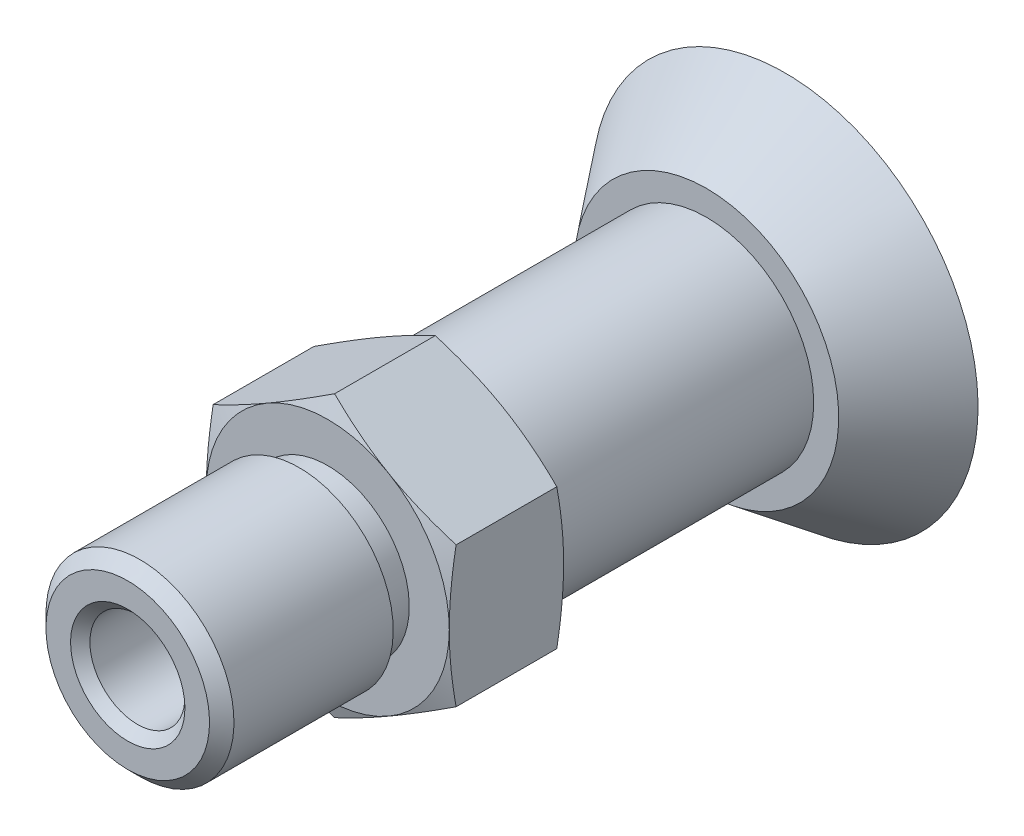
ISO-10303-21;
HEADER;
FILE_DESCRIPTION(('STEP AP214'),'2;1');
FILE_NAME('part.step','',(''),(''),'','','');
FILE_SCHEMA(('AUTOMOTIVE_DESIGN { 1 0 10303 214 1 1 1 1 }'));
ENDSEC;
DATA;
#1=APPLICATION_CONTEXT('core data for automotive mechanical design processes');
#2=APPLICATION_PROTOCOL_DEFINITION('international standard','automotive_design',2000,#1);
#3=PRODUCT_CONTEXT('',#1,'mechanical');
#4=PRODUCT('Part','Part','',(#3));
#5=PRODUCT_RELATED_PRODUCT_CATEGORY('part','',(#4));
#6=PRODUCT_DEFINITION_FORMATION('','',#4);
#7=PRODUCT_DEFINITION_CONTEXT('part definition',#1,'design');
#8=PRODUCT_DEFINITION('design','',#6,#7);
#9=PRODUCT_DEFINITION_SHAPE('','',#8);
#10=(LENGTH_UNIT() NAMED_UNIT(*) SI_UNIT(.MILLI.,.METRE.));
#11=(NAMED_UNIT(*) PLANE_ANGLE_UNIT() SI_UNIT($,.RADIAN.));
#12=(NAMED_UNIT(*) SI_UNIT($,.STERADIAN.) SOLID_ANGLE_UNIT());
#13=UNCERTAINTY_MEASURE_WITH_UNIT(LENGTH_MEASURE(1.E-05),#10,'distance_accuracy_value','');
#14=(GEOMETRIC_REPRESENTATION_CONTEXT(3) GLOBAL_UNCERTAINTY_ASSIGNED_CONTEXT((#13)) GLOBAL_UNIT_ASSIGNED_CONTEXT((#10,
#11,#12)) REPRESENTATION_CONTEXT('',''));
#15=CARTESIAN_POINT('',(0.,0.,0.));
#16=DIRECTION('',(0.,0.,1.));
#17=DIRECTION('',(1.,0.,0.));
#18=AXIS2_PLACEMENT_3D('',#15,#16,#17);
#19=CARTESIAN_POINT('',(0.,0.,24.));
#20=DIRECTION('',(0.,0.,-1.));
#21=DIRECTION('',(0.,-1.,0.));
#22=AXIS2_PLACEMENT_3D('',#19,#20,#21);
#23=CYLINDRICAL_SURFACE('',#22,3.3235);
#24=CARTESIAN_POINT('',(0.,0.,45.3235));
#25=DIRECTION('',(0.,0.,-1.));
#26=DIRECTION('',(0.,-1.,0.));
#27=AXIS2_PLACEMENT_3D('',#24,#25,#26);
#28=CIRCLE('',#27,3.3235);
#29=CARTESIAN_POINT('',(0.,-3.3235,45.3235));
#30=VERTEX_POINT('',#29);
#31=EDGE_CURVE('E10',#30,#30,#28,.T.);
#32=ORIENTED_EDGE('',*,*,#31,.F.);
#33=EDGE_LOOP('',(#32));
#34=FACE_BOUND('',#33,.T.);
#35=CARTESIAN_POINT('',(0.,0.,24.));
#36=DIRECTION('',(0.,0.,-1.));
#37=DIRECTION('',(0.,-1.,0.));
#38=AXIS2_PLACEMENT_3D('',#35,#36,#37);
#39=CIRCLE('',#38,3.3235);
#40=CARTESIAN_POINT('',(0.,-3.3235,24.));
#41=VERTEX_POINT('',#40);
#42=EDGE_CURVE('E29',#41,#41,#39,.T.);
#43=ORIENTED_EDGE('',*,*,#42,.T.);
#44=EDGE_LOOP('',(#43));
#45=FACE_BOUND('',#44,.T.);
#46=ADVANCED_FACE('F15',(#34,#45),#23,.F.);
#47=CARTESIAN_POINT('',(0.,0.,46.));
#48=DIRECTION('',(0.,0.,1.));
#49=DIRECTION('',(0.,1.,0.));
#50=AXIS2_PLACEMENT_3D('',#47,#48,#49);
#51=CONICAL_SURFACE('',#50,4.,0.785398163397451);
#52=CARTESIAN_POINT('',(0.,0.,46.));
#53=DIRECTION('',(0.,0.,-1.));
#54=DIRECTION('',(0.,-1.,0.));
#55=AXIS2_PLACEMENT_3D('',#52,#53,#54);
#56=CIRCLE('',#55,4.);
#57=CARTESIAN_POINT('',(0.,-4.,46.));
#58=VERTEX_POINT('',#57);
#59=EDGE_CURVE('E212',#58,#58,#56,.T.);
#60=ORIENTED_EDGE('',*,*,#59,.F.);
#61=EDGE_LOOP('',(#60));
#62=FACE_BOUND('',#61,.T.);
#63=ORIENTED_EDGE('',*,*,#31,.T.);
#64=EDGE_LOOP('',(#63));
#65=FACE_BOUND('',#64,.T.);
#66=ADVANCED_FACE('F610',(#62,#65),#51,.F.);
#67=CARTESIAN_POINT('',(0.,0.,24.));
#68=DIRECTION('',(0.,0.,-1.));
#69=DIRECTION('',(0.,-1.,0.));
#70=AXIS2_PLACEMENT_3D('',#67,#68,#69);
#71=PLANE('',#70);
#72=ORIENTED_EDGE('',*,*,#42,.F.);
#73=EDGE_LOOP('',(#72));
#74=FACE_BOUND('',#73,.T.);
#75=CARTESIAN_POINT('',(0.,0.,24.));
#76=DIRECTION('',(0.,0.,-1.));
#77=DIRECTION('',(0.,-1.,0.));
#78=AXIS2_PLACEMENT_3D('',#75,#76,#77);
#79=CIRCLE('',#78,4.5);
#80=CARTESIAN_POINT('',(0.,-4.5,24.));
#81=VERTEX_POINT('',#80);
#82=EDGE_CURVE('E847',#81,#81,#79,.T.);
#83=ORIENTED_EDGE('',*,*,#82,.T.);
#84=EDGE_LOOP('',(#83));
#85=FACE_BOUND('',#84,.T.);
#86=ADVANCED_FACE('F612',(#74,#85),#71,.T.);
#87=CARTESIAN_POINT('',(0.,0.,0.));
#88=DIRECTION('',(0.,0.,-1.));
#89=DIRECTION('',(0.,-1.,0.));
#90=AXIS2_PLACEMENT_3D('',#87,#88,#89);
#91=CYLINDRICAL_SURFACE('',#90,4.5);
#92=ORIENTED_EDGE('',*,*,#82,.F.);
#93=EDGE_LOOP('',(#92));
#94=FACE_BOUND('',#93,.T.);
#95=CARTESIAN_POINT('',(0.,0.,3.));
#96=DIRECTION('',(0.,0.,-1.));
#97=DIRECTION('',(0.,1.,0.));
#98=AXIS2_PLACEMENT_3D('',#95,#96,#97);
#99=CIRCLE('',#98,4.5);
#100=CARTESIAN_POINT('',(0.,4.5,3.));
#101=VERTEX_POINT('',#100);
#102=EDGE_CURVE('E223',#101,#101,#99,.T.);
#103=ORIENTED_EDGE('',*,*,#102,.T.);
#104=EDGE_LOOP('',(#103));
#105=FACE_BOUND('',#104,.T.);
#106=ADVANCED_FACE('F811',(#94,#105),#91,.F.);
#107=CARTESIAN_POINT('',(0.,0.,32.));
#108=DIRECTION('',(0.,0.,-1.));
#109=DIRECTION('',(0.,-1.,0.));
#110=AXIS2_PLACEMENT_3D('',#107,#108,#109);
#111=CYLINDRICAL_SURFACE('',#110,5.7);
#112=CARTESIAN_POINT('',(0.,0.,34.));
#113=DIRECTION('',(0.,0.,-1.));
#114=DIRECTION('',(0.,-1.,0.));
#115=AXIS2_PLACEMENT_3D('',#112,#113,#114);
#116=CIRCLE('',#115,5.7);
#117=CARTESIAN_POINT('',(0.,-5.7,34.));
#118=VERTEX_POINT('',#117);
#119=EDGE_CURVE('E850',#118,#118,#116,.T.);
#120=ORIENTED_EDGE('',*,*,#119,.T.);
#121=EDGE_LOOP('',(#120));
#122=FACE_BOUND('',#121,.T.);
#123=CARTESIAN_POINT('',(0.,0.,32.));
#124=DIRECTION('',(0.,0.,-1.));
#125=DIRECTION('',(0.,-1.,0.));
#126=AXIS2_PLACEMENT_3D('',#123,#124,#125);
#127=CIRCLE('',#126,5.7);
#128=CARTESIAN_POINT('',(0.,-5.7,32.));
#129=VERTEX_POINT('',#128);
#130=EDGE_CURVE('E200',#129,#129,#127,.T.);
#131=ORIENTED_EDGE('',*,*,#130,.F.);
#132=EDGE_LOOP('',(#131));
#133=FACE_BOUND('',#132,.T.);
#134=ADVANCED_FACE('F471',(#122,#133),#111,.T.);
#135=CARTESIAN_POINT('',(-6.5785,0.,34.));
#136=DIRECTION('',(0.,0.,1.));
#137=DIRECTION('',(-1.,0.,0.));
#138=AXIS2_PLACEMENT_3D('',#135,#136,#137);
#139=PLANE('',#138);
#140=CARTESIAN_POINT('',(0.,0.,34.));
#141=DIRECTION('',(0.,0.,-1.));
#142=DIRECTION('',(0.,-1.,0.));
#143=AXIS2_PLACEMENT_3D('',#140,#141,#142);
#144=CIRCLE('',#143,6.5785);
#145=CARTESIAN_POINT('',(0.,-6.5785,34.));
#146=VERTEX_POINT('',#145);
#147=EDGE_CURVE('E860',#146,#146,#144,.T.);
#148=ORIENTED_EDGE('',*,*,#147,.T.);
#149=EDGE_LOOP('',(#148));
#150=FACE_BOUND('',#149,.T.);
#151=ORIENTED_EDGE('',*,*,#119,.F.);
#152=EDGE_LOOP('',(#151));
#153=FACE_BOUND('',#152,.T.);
#154=ADVANCED_FACE('F400',(#150,#153),#139,.F.);
#155=CARTESIAN_POINT('',(0.,0.,32.));
#156=DIRECTION('',(0.,0.,-1.));
#157=DIRECTION('',(0.,-1.,0.));
#158=AXIS2_PLACEMENT_3D('',#155,#156,#157);
#159=CYLINDRICAL_SURFACE('',#158,6.5785);
#160=CARTESIAN_POINT('',(0.,0.,45.144));
#161=DIRECTION('',(0.,0.,-1.));
#162=DIRECTION('',(0.,-1.,0.));
#163=AXIS2_PLACEMENT_3D('',#160,#161,#162);
#164=CIRCLE('',#163,6.5785);
#165=CARTESIAN_POINT('',(0.,-6.5785,45.144));
#166=VERTEX_POINT('',#165);
#167=EDGE_CURVE('E226',#166,#166,#164,.T.);
#168=ORIENTED_EDGE('',*,*,#167,.T.);
#169=EDGE_LOOP('',(#168));
#170=FACE_BOUND('',#169,.T.);
#171=ORIENTED_EDGE('',*,*,#147,.F.);
#172=EDGE_LOOP('',(#171));
#173=FACE_BOUND('',#172,.T.);
#174=ADVANCED_FACE('F870',(#170,#173),#159,.T.);
#175=CARTESIAN_POINT('',(0.,0.,46.));
#176=DIRECTION('',(0.,0.,-1.));
#177=DIRECTION('',(0.,-1.,0.));
#178=AXIS2_PLACEMENT_3D('',#175,#176,#177);
#179=CONICAL_SURFACE('',#178,5.7225,0.785398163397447);
#180=CARTESIAN_POINT('',(0.,0.,46.));
#181=DIRECTION('',(0.,0.,-1.));
#182=DIRECTION('',(0.,-1.,0.));
#183=AXIS2_PLACEMENT_3D('',#180,#181,#182);
#184=CIRCLE('',#183,5.7225);
#185=CARTESIAN_POINT('',(0.,-5.7225,46.));
#186=VERTEX_POINT('',#185);
#187=EDGE_CURVE('E204',#186,#186,#184,.T.);
#188=ORIENTED_EDGE('',*,*,#187,.T.);
#189=EDGE_LOOP('',(#188));
#190=FACE_BOUND('',#189,.T.);
#191=ORIENTED_EDGE('',*,*,#167,.F.);
#192=EDGE_LOOP('',(#191));
#193=FACE_BOUND('',#192,.T.);
#194=ADVANCED_FACE('F872',(#190,#193),#179,.T.);
#195=CARTESIAN_POINT('',(0.,0.,46.));
#196=DIRECTION('',(0.,0.,-1.));
#197=DIRECTION('',(0.,-1.,0.));
#198=AXIS2_PLACEMENT_3D('',#195,#196,#197);
#199=PLANE('',#198);
#200=ORIENTED_EDGE('',*,*,#59,.T.);
#201=EDGE_LOOP('',(#200));
#202=FACE_BOUND('',#201,.T.);
#203=ORIENTED_EDGE('',*,*,#187,.F.);
#204=EDGE_LOOP('',(#203));
#205=FACE_BOUND('',#204,.T.);
#206=ADVANCED_FACE('F310',(#202,#205),#199,.F.);
#207=CARTESIAN_POINT('',(0.,0.,32.));
#208=DIRECTION('',(0.,0.,-1.));
#209=DIRECTION('',(0.,-1.,0.));
#210=AXIS2_PLACEMENT_3D('',#207,#208,#209);
#211=CONICAL_SURFACE('',#210,8.5,1.22173047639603);
#212=CARTESIAN_POINT('',(4.24999999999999,7.36121593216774,32.));
#213=CARTESIAN_POINT('',(4.07319374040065,7.46322408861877,32.0000396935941));
#214=CARTESIAN_POINT('',(3.8963496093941,7.56516622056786,31.9973968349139));
#215=CARTESIAN_POINT('',(3.54361703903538,7.76856925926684,31.9868168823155));
#216=CARTESIAN_POINT('',(3.3677279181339,7.8700302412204,31.9789039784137));
#217=CARTESIAN_POINT('',(3.01526923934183,8.07365721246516,31.9577912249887));
#218=CARTESIAN_POINT('',(2.83870190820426,8.17582378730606,31.944560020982));
#219=CARTESIAN_POINT('',(2.48307905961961,8.38158393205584,31.9128951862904));
#220=CARTESIAN_POINT('',(2.3040288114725,8.48517424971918,31.8943818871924));
#221=CARTESIAN_POINT('',(1.95081866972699,8.68915189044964,31.8531920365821));
#222=CARTESIAN_POINT('',(1.77665238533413,8.78955260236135,31.8306359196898));
#223=CARTESIAN_POINT('',(1.42701414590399,8.99117527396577,31.7809950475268));
#224=CARTESIAN_POINT('',(1.25154722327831,9.09239503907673,31.753866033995));
#225=CARTESIAN_POINT('',(0.898296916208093,9.29625485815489,31.6951216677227));
#226=CARTESIAN_POINT('',(0.720522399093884,9.39889116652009,31.6634403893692));
#227=CARTESIAN_POINT('',(0.361731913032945,9.60606533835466,31.5956086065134));
#228=CARTESIAN_POINT('',(0.180727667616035,9.71059707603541,31.5593772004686));
#229=CARTESIAN_POINT('',(0.,9.81495457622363,31.5213956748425));
#230=B_SPLINE_CURVE_WITH_KNOTS('',3,(#212,#213,#214,#215,#216,#217,#218,#219,#220,#221,#222,
#223,#224,#225,#226,#227,#228,#229),.UNSPECIFIED.,.F.,.F.,(4,2,2,2,2,2,2,2,4),(0.,
0.612350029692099,1.22190850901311,1.83511467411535,2.45810863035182,3.06494424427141,
3.67803120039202,4.30111252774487,4.93748157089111),.UNSPECIFIED.);
#231=CARTESIAN_POINT('',(4.25,7.36121593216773,32.));
#232=VERTEX_POINT('',#231);
#233=CARTESIAN_POINT('',(0.,9.81495457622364,31.5213956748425));
#234=VERTEX_POINT('',#233);
#235=EDGE_CURVE('E425',#232,#234,#230,.T.);
#236=ORIENTED_EDGE('',*,*,#235,.T.);
#237=CARTESIAN_POINT('',(0.,9.81495457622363,31.5213956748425));
#238=CARTESIAN_POINT('',(-0.180706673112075,9.71060937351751,31.5593727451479));
#239=CARTESIAN_POINT('',(-0.361690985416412,9.60609170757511,31.5955994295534));
#240=CARTESIAN_POINT('',(-0.720456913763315,9.39893807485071,31.6634251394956));
#241=CARTESIAN_POINT('',(-0.898226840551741,9.29630818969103,31.6951047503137));
#242=CARTESIAN_POINT('',(-1.25148074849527,9.09245180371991,31.7538489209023));
#243=CARTESIAN_POINT('',(-1.42695592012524,8.99122905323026,31.7809790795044));
#244=CARTESIAN_POINT('',(-1.77661900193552,8.78958645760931,31.8306264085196));
#245=CARTESIAN_POINT('',(-1.95080195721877,8.68916885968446,31.8531875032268));
#246=CARTESIAN_POINT('',(-2.30400498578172,8.48518049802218,31.8943817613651));
#247=CARTESIAN_POINT('',(-2.48303139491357,8.38159646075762,31.9128955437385));
#248=CARTESIAN_POINT('',(-2.83862443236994,8.17584805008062,31.944560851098));
#249=CARTESIAN_POINT('',(-3.0151857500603,8.07368680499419,31.9577916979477));
#250=CARTESIAN_POINT('',(-3.36764690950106,7.87006407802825,31.978904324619));
#251=CARTESIAN_POINT('',(-3.54354454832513,7.76860200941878,31.9868170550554));
#252=CARTESIAN_POINT('',(-3.89630730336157,7.56518792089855,31.9973970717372));
#253=CARTESIAN_POINT('',(-4.0731731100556,7.46323581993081,32.0000397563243));
#254=CARTESIAN_POINT('',(-4.25,7.36121593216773,32.));
#255=B_SPLINE_CURVE_WITH_KNOTS('',3,(#237,#238,#239,#240,#241,#242,#243,#244,#245,#246,#247,
#248,#249,#250,#251,#252,#253,#254),.UNSPECIFIED.,.F.,.F.,(4,2,2,2,2,2,2,2,4),(0.,
0.636294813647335,1.2593540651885,1.87246719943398,2.47937270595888,3.10229571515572,
3.71547818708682,4.32506039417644,4.93748165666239),.UNSPECIFIED.);
#256=CARTESIAN_POINT('',(-4.25,7.36121593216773,32.));
#257=VERTEX_POINT('',#256);
#258=EDGE_CURVE('E430',#234,#257,#255,.T.);
#259=ORIENTED_EDGE('',*,*,#258,.T.);
#260=CARTESIAN_POINT('',(0.,0.,32.));
#261=DIRECTION('',(0.,0.,-1.));
#262=DIRECTION('',(0.,-1.,0.));
#263=AXIS2_PLACEMENT_3D('',#260,#261,#262);
#264=CIRCLE('',#263,8.5);
#265=EDGE_CURVE('E205',#257,#232,#264,.T.);
#266=ORIENTED_EDGE('',*,*,#265,.T.);
#267=EDGE_LOOP('',(#236,#259,#266));
#268=FACE_BOUND('',#267,.T.);
#269=ADVANCED_FACE('F462',(#268),#211,.T.);
#270=CARTESIAN_POINT('',(0.,0.,32.));
#271=DIRECTION('',(0.,0.,-1.));
#272=DIRECTION('',(0.,-1.,0.));
#273=AXIS2_PLACEMENT_3D('',#270,#271,#272);
#274=PLANE('',#273);
#275=ORIENTED_EDGE('',*,*,#130,.T.);
#276=EDGE_LOOP('',(#275));
#277=FACE_BOUND('',#276,.T.);
#278=CARTESIAN_POINT('',(0.,0.,32.));
#279=DIRECTION('',(0.,0.,-1.));
#280=DIRECTION('',(0.,-1.,0.));
#281=AXIS2_PLACEMENT_3D('',#278,#279,#280);
#282=CIRCLE('',#281,8.5);
#283=CARTESIAN_POINT('',(-8.5,0.,32.));
#284=VERTEX_POINT('',#283);
#285=EDGE_CURVE('E414',#284,#257,#282,.T.);
#286=ORIENTED_EDGE('',*,*,#285,.F.);
#287=CARTESIAN_POINT('',(0.,0.,32.));
#288=DIRECTION('',(0.,0.,-1.));
#289=DIRECTION('',(0.,-1.,0.));
#290=AXIS2_PLACEMENT_3D('',#287,#288,#289);
#291=CIRCLE('',#290,8.5);
#292=CARTESIAN_POINT('',(-4.25,-7.36121593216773,32.));
#293=VERTEX_POINT('',#292);
#294=EDGE_CURVE('E134',#293,#284,#291,.T.);
#295=ORIENTED_EDGE('',*,*,#294,.F.);
#296=CARTESIAN_POINT('',(0.,0.,32.));
#297=DIRECTION('',(0.,0.,-1.));
#298=DIRECTION('',(0.,-1.,0.));
#299=AXIS2_PLACEMENT_3D('',#296,#297,#298);
#300=CIRCLE('',#299,8.5);
#301=CARTESIAN_POINT('',(4.25,-7.36121593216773,32.));
#302=VERTEX_POINT('',#301);
#303=EDGE_CURVE('E1407',#302,#293,#300,.T.);
#304=ORIENTED_EDGE('',*,*,#303,.F.);
#305=CARTESIAN_POINT('',(0.,0.,32.));
#306=DIRECTION('',(0.,0.,-1.));
#307=DIRECTION('',(0.,-1.,0.));
#308=AXIS2_PLACEMENT_3D('',#305,#306,#307);
#309=CIRCLE('',#308,8.5);
#310=CARTESIAN_POINT('',(8.5,0.,32.));
#311=VERTEX_POINT('',#310);
#312=EDGE_CURVE('E422',#311,#302,#309,.T.);
#313=ORIENTED_EDGE('',*,*,#312,.F.);
#314=CARTESIAN_POINT('',(0.,0.,32.));
#315=DIRECTION('',(0.,0.,-1.));
#316=DIRECTION('',(0.,-1.,0.));
#317=AXIS2_PLACEMENT_3D('',#314,#315,#316);
#318=CIRCLE('',#317,8.5);
#319=EDGE_CURVE('E416',#232,#311,#318,.T.);
#320=ORIENTED_EDGE('',*,*,#319,.F.);
#321=ORIENTED_EDGE('',*,*,#265,.F.);
#322=EDGE_LOOP('',(#286,#295,#304,#313,#320,#321));
#323=FACE_BOUND('',#322,.T.);
#324=ADVANCED_FACE('F201',(#277,#323),#274,.F.);
#325=CARTESIAN_POINT('',(0.,0.,32.));
#326=DIRECTION('',(0.,0.,-1.));
#327=DIRECTION('',(0.,-1.,0.));
#328=AXIS2_PLACEMENT_3D('',#325,#326,#327);
#329=CONICAL_SURFACE('',#328,8.5,1.22173047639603);
#330=CARTESIAN_POINT('',(-8.5,0.,32.));
#331=CARTESIAN_POINT('',(-8.4999365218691,-0.206011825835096,32.0000410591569));
#332=CARTESIAN_POINT('',(-8.49978501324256,-0.412023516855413,31.9973528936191));
#333=CARTESIAN_POINT('',(-8.49953627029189,-0.822909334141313,31.9865892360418));
#334=CARTESIAN_POINT('',(-8.49943877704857,-1.02778414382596,31.9785398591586));
#335=CARTESIAN_POINT('',(-8.49952360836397,-1.43845761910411,31.9570613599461));
#336=CARTESIAN_POINT('',(-8.49970758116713,-1.6442546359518,31.9436008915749));
#337=CARTESIAN_POINT('',(-8.50007672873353,-2.05874685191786,31.9113875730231));
#338=CARTESIAN_POINT('',(-8.50026187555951,-2.26743568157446,31.8925534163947));
#339=CARTESIAN_POINT('',(-8.50031129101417,-2.67529221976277,31.8510228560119));
#340=CARTESIAN_POINT('',(-8.50018911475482,-2.87448069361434,31.8285291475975));
#341=CARTESIAN_POINT('',(-8.50000874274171,-3.27442667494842,31.7790938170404));
#342=CARTESIAN_POINT('',(-8.49995123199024,-3.47517870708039,31.7521079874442));
#343=CARTESIAN_POINT('',(-8.49990420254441,-3.87939283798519,31.6937297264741));
#344=CARTESIAN_POINT('',(-8.49991581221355,-4.08284550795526,31.6622723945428));
#345=CARTESIAN_POINT('',(-8.49995754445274,-4.49347331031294,31.5949671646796));
#346=CARTESIAN_POINT('',(-8.49998805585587,-4.70063548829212,31.5590400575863));
#347=CARTESIAN_POINT('',(-8.5,-4.90747728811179,31.5213956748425));
#348=B_SPLINE_CURVE_WITH_KNOTS('',3,(#330,#331,#332,#333,#334,#335,#336,#337,#338,#339,#340,
#341,#342,#343,#344,#345,#346,#347),.UNSPECIFIED.,.F.,.F.,(4,2,2,2,2,2,2,2,4),(0.,
0.618016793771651,1.23304495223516,1.85168848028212,2.48023974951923,3.08155780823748,
3.68918733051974,4.30676306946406,4.93748547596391),.UNSPECIFIED.);
#349=CARTESIAN_POINT('',(-8.5,-4.90747728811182,31.5213956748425));
#350=VERTEX_POINT('',#349);
#351=EDGE_CURVE('E145',#284,#350,#348,.T.);
#352=ORIENTED_EDGE('',*,*,#351,.T.);
#353=CARTESIAN_POINT('',(-8.49999999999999,-4.90747728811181,31.5213956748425));
#354=CARTESIAN_POINT('',(-8.31928106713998,-5.01180125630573,31.5593727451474));
#355=CARTESIAN_POINT('',(-8.13827395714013,-5.1162794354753,31.5955994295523));
#356=CARTESIAN_POINT('',(-7.77949068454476,-5.32340302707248,31.6634251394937));
#357=CARTESIAN_POINT('',(-7.60172563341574,-5.42604135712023,31.6951047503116));
#358=CARTESIAN_POINT('',(-7.24855387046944,-5.63004002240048,31.7538489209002));
#359=CARTESIAN_POINT('',(-7.07315481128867,-5.73139460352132,31.7809790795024));
#360=CARTESIAN_POINT('',(-6.72369566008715,-5.93339041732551,31.8306264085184));
#361=CARTESIAN_POINT('',(-6.5496399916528,-6.03402848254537,31.8531875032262));
#362=CARTESIAN_POINT('',(-6.19637937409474,-6.23791709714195,31.894381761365));
#363=CARTESIAN_POINT('',(-6.01715976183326,-6.34116649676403,31.9128955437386));
#364=CARTESIAN_POINT('',(-5.66117989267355,-6.5462448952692,31.9445608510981));
#365=CARTESIAN_POINT('',(-5.4844250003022,-6.64807085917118,31.9577916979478));
#366=CARTESIAN_POINT('',(-5.13185196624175,-6.85149981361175,31.9789043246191));
#367=CARTESIAN_POINT('',(-4.95603441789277,-6.95310060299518,31.9868170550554));
#368=CARTESIAN_POINT('',(-4.60349127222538,-7.15689506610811,31.9973970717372));
#369=CARTESIAN_POINT('',(-4.42676525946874,-7.25908929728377,32.0000397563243));
#370=CARTESIAN_POINT('',(-4.25,-7.36121593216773,32.));
#371=B_SPLINE_CURVE_WITH_KNOTS('',3,(#353,#354,#355,#356,#357,#358,#359,#360,#361,#362,#363,
#364,#365,#366,#367,#368,#369,#370),.UNSPECIFIED.,.F.,.F.,(4,2,2,2,2,2,2,2,4),(0.,
0.636294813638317,1.25935406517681,1.87246719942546,2.47937270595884,3.10229571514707,
3.7154781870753,4.3250603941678,4.93748165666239),.UNSPECIFIED.);
#372=EDGE_CURVE('E374',#350,#293,#371,.T.);
#373=ORIENTED_EDGE('',*,*,#372,.T.);
#374=ORIENTED_EDGE('',*,*,#294,.T.);
#375=EDGE_LOOP('',(#352,#373,#374));
#376=FACE_BOUND('',#375,.T.);
#377=ADVANCED_FACE('F750',(#376),#329,.T.);
#378=CARTESIAN_POINT('',(0.,0.,32.));
#379=DIRECTION('',(0.,0.,-1.));
#380=DIRECTION('',(0.,-1.,0.));
#381=AXIS2_PLACEMENT_3D('',#378,#379,#380);
#382=CONICAL_SURFACE('',#381,8.5,1.22173047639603);
#383=ORIENTED_EDGE('',*,*,#303,.T.);
#384=CARTESIAN_POINT('',(-4.25,-7.36121593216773,32.));
#385=CARTESIAN_POINT('',(-4.07319374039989,-7.4632240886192,32.0000396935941));
#386=CARTESIAN_POINT('',(-3.89634960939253,-7.56516622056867,31.9973968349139));
#387=CARTESIAN_POINT('',(-3.54361703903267,-7.76856925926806,31.9868168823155));
#388=CARTESIAN_POINT('',(-3.36772791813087,-7.87003024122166,31.9789039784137));
#389=CARTESIAN_POINT('',(-3.0152692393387,-8.07365721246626,31.9577912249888));
#390=CARTESIAN_POINT('',(-2.83870190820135,-8.17582378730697,31.944560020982));
#391=CARTESIAN_POINT('',(-2.48307905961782,-8.38158393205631,31.9128951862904));
#392=CARTESIAN_POINT('',(-2.3040288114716,-8.48517424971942,31.8943818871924));
#393=CARTESIAN_POINT('',(-1.95081866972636,-8.68915189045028,31.8531920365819));
#394=CARTESIAN_POINT('',(-1.77665238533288,-8.78955260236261,31.8306359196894));
#395=CARTESIAN_POINT('',(-1.42701414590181,-8.99117527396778,31.7809950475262));
#396=CARTESIAN_POINT('',(-1.25154722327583,-9.09239503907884,31.7538660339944));
#397=CARTESIAN_POINT('',(-0.898296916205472,-9.29625485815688,31.695121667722));
#398=CARTESIAN_POINT('',(-0.720522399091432,-9.39889116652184,31.6634403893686));
#399=CARTESIAN_POINT('',(-0.361731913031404,-9.60606533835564,31.5956086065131));
#400=CARTESIAN_POINT('',(-0.180727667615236,-9.71059707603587,31.5593772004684));
#401=CARTESIAN_POINT('',(0.,-9.81495457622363,31.5213956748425));
#402=B_SPLINE_CURVE_WITH_KNOTS('',3,(#384,#385,#386,#387,#388,#389,#390,#391,#392,#393,#394,
#395,#396,#397,#398,#399,#400,#401),.UNSPECIFIED.,.F.,.F.,(4,2,2,2,2,2,2,2,4),(0.,
0.612350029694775,1.22190850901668,1.83511467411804,2.45810863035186,3.06494424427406,
3.67803120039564,4.30111252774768,4.93748157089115),.UNSPECIFIED.);
#403=CARTESIAN_POINT('',(0.,-9.81495457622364,31.5213956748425));
#404=VERTEX_POINT('',#403);
#405=EDGE_CURVE('E1431',#293,#404,#402,.T.);
#406=ORIENTED_EDGE('',*,*,#405,.T.);
#407=CARTESIAN_POINT('',(0.,-9.81495457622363,31.5213956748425));
#408=CARTESIAN_POINT('',(0.180706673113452,-9.7106093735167,31.5593727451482));
#409=CARTESIAN_POINT('',(0.361690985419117,-9.60609170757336,31.595599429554));
#410=CARTESIAN_POINT('',(0.720456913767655,-9.39893807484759,31.6634251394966));
#411=CARTESIAN_POINT('',(0.898226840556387,-9.29630818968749,31.6951047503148));
#412=CARTESIAN_POINT('',(1.25148074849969,-9.09245180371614,31.7538489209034));
#413=CARTESIAN_POINT('',(1.4269559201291,-8.99122905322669,31.7809790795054));
#414=CARTESIAN_POINT('',(1.77661900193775,-8.78958645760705,31.8306264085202));
#415=CARTESIAN_POINT('',(1.95080195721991,-8.68916885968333,31.8531875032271));
#416=CARTESIAN_POINT('',(2.30400498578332,-8.48518049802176,31.8943817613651));
#417=CARTESIAN_POINT('',(2.48303139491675,-8.38159646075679,31.9128955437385));
#418=CARTESIAN_POINT('',(2.8386244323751,-8.175848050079,31.944560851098));
#419=CARTESIAN_POINT('',(3.01518575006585,-8.07368680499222,31.9577916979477));
#420=CARTESIAN_POINT('',(3.36764690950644,-7.87006407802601,31.978904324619));
#421=CARTESIAN_POINT('',(3.54354454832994,-7.76860200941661,31.9868170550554));
#422=CARTESIAN_POINT('',(3.89630730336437,-7.56518792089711,31.9973970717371));
#423=CARTESIAN_POINT('',(4.07317311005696,-7.46323581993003,32.0000397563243));
#424=CARTESIAN_POINT('',(4.24999999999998,-7.36121593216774,32.));
#425=B_SPLINE_CURVE_WITH_KNOTS('',3,(#407,#408,#409,#410,#411,#412,#413,#414,#415,#416,#417,
#418,#419,#420,#421,#422,#423,#424),.UNSPECIFIED.,.F.,.F.,(4,2,2,2,2,2,2,2,4),(0.,
0.636294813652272,1.25935406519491,1.87246719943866,2.47937270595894,3.10229571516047,
3.71547818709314,4.32506039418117,4.93748165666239),.UNSPECIFIED.);
#426=EDGE_CURVE('E1432',#404,#302,#425,.T.);
#427=ORIENTED_EDGE('',*,*,#426,.T.);
#428=EDGE_LOOP('',(#383,#406,#427));
#429=FACE_BOUND('',#428,.T.);
#430=ADVANCED_FACE('F655',(#429),#382,.T.);
#431=CARTESIAN_POINT('',(0.,0.,32.));
#432=DIRECTION('',(0.,0.,-1.));
#433=DIRECTION('',(0.,-1.,0.));
#434=AXIS2_PLACEMENT_3D('',#431,#432,#433);
#435=CONICAL_SURFACE('',#434,8.5,1.22173047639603);
#436=ORIENTED_EDGE('',*,*,#312,.T.);
#437=CARTESIAN_POINT('',(4.24999999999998,-7.36121593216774,32.));
#438=CARTESIAN_POINT('',(4.42674478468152,-7.25910129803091,32.0000396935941));
#439=CARTESIAN_POINT('',(4.60345132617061,-7.15692085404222,31.9973968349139));
#440=CARTESIAN_POINT('',(4.95596981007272,-6.95314700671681,31.9868168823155));
#441=CARTESIAN_POINT('',(5.13178215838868,-6.85155305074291,31.9789039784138));
#442=CARTESIAN_POINT('',(5.48435762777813,-6.64812836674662,31.9577912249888));
#443=CARTESIAN_POINT('',(5.66112014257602,-6.54629985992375,31.944560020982));
#444=CARTESIAN_POINT('',(6.01712507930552,-6.34120151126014,31.9128951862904));
#445=CARTESIAN_POINT('',(6.19636205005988,-6.23793460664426,31.8943818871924));
#446=CARTESIAN_POINT('',(6.54961693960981,-6.03403447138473,31.8531920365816));
#447=CARTESIAN_POINT('',(6.72364964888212,-5.93340240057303,31.8306359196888));
#448=CARTESIAN_POINT('',(7.07307912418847,-5.73141813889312,31.7809950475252));
#449=CARTESIAN_POINT('',(7.24847147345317,-5.63006920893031,31.7538660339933));
#450=CARTESIAN_POINT('',(7.60164440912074,-5.42607537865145,31.695121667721));
#451=CARTESIAN_POINT('',(7.77941731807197,-5.32343628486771,31.6634403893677));
#452=CARTESIAN_POINT('',(8.13823065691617,-5.11630169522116,31.5956086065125));
#453=CARTESIAN_POINT('',(8.31925991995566,-5.01181328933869,31.5593772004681));
#454=CARTESIAN_POINT('',(8.49999999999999,-4.90747728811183,31.5213956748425));
#455=B_SPLINE_CURVE_WITH_KNOTS('',3,(#437,#438,#439,#440,#441,#442,#443,#444,#445,#446,#447,
#448,#449,#450,#451,#452,#453,#454),.UNSPECIFIED.,.F.,.F.,(4,2,2,2,2,2,2,2,4),(0.,
0.612350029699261,1.22190850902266,1.83511467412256,2.45810863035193,3.06494424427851,
3.67803120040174,4.30111252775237,4.93748157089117),.UNSPECIFIED.);
#456=CARTESIAN_POINT('',(8.5,-4.90747728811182,31.5213956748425));
#457=VERTEX_POINT('',#456);
#458=EDGE_CURVE('E1350',#302,#457,#455,.T.);
#459=ORIENTED_EDGE('',*,*,#458,.T.);
#460=CARTESIAN_POINT('',(8.49999999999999,-4.90747728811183,31.5213956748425));
#461=CARTESIAN_POINT('',(8.49998787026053,-4.7002814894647,31.559104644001));
#462=CARTESIAN_POINT('',(8.49997059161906,-4.49276345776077,31.5950861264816));
#463=CARTESIAN_POINT('',(8.49996813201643,-4.08136837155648,31.662490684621));
#464=CARTESIAN_POINT('',(8.49998229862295,-3.87750414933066,31.6939922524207));
#465=CARTESIAN_POINT('',(8.50008042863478,-3.47240811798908,31.752449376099));
#466=CARTESIAN_POINT('',(8.50016328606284,-3.271185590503,31.7794688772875));
#467=CARTESIAN_POINT('',(8.50037710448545,-2.87023610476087,31.8289630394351));
#468=CARTESIAN_POINT('',(8.50050757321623,-2.67051446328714,31.8514806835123));
#469=CARTESIAN_POINT('',(8.50045089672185,-2.2625088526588,31.892945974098));
#470=CARTESIAN_POINT('',(8.5002506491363,-2.05420628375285,31.9117116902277));
#471=CARTESIAN_POINT('',(8.49984434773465,-1.64051720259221,31.9438068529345));
#472=CARTESIAN_POINT('',(8.499638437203,-1.43513708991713,31.9572181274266));
#473=CARTESIAN_POINT('',(8.49950879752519,-1.02533835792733,31.9786175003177));
#474=CARTESIAN_POINT('',(8.49958336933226,-0.820921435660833,31.986637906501));
#475=CARTESIAN_POINT('',(8.49979717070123,-0.411003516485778,31.9973619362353));
#476=CARTESIAN_POINT('',(8.4999366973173,-0.205501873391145,32.0000408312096));
#477=CARTESIAN_POINT('',(8.5,0.,32.));
#478=B_SPLINE_CURVE_WITH_KNOTS('',3,(#460,#461,#462,#463,#464,#465,#466,#467,#468,#469,#470,
#471,#472,#473,#474,#475,#476,#477),.UNSPECIFIED.,.F.,.F.,(4,2,2,2,2,2,2,2,4),(0.,
0.631801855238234,1.25061773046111,1.85965938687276,2.46257461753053,3.08995383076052,
3.70734016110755,4.32099265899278,4.93747953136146),.UNSPECIFIED.);
#479=EDGE_CURVE('E1346',#457,#311,#478,.T.);
#480=ORIENTED_EDGE('',*,*,#479,.T.);
#481=EDGE_LOOP('',(#436,#459,#480));
#482=FACE_BOUND('',#481,.T.);
#483=ADVANCED_FACE('F256',(#482),#435,.T.);
#484=CARTESIAN_POINT('',(0.,0.,32.));
#485=DIRECTION('',(0.,0.,-1.));
#486=DIRECTION('',(0.,-1.,0.));
#487=AXIS2_PLACEMENT_3D('',#484,#485,#486);
#488=CONICAL_SURFACE('',#487,8.5,1.22173047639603);
#489=ORIENTED_EDGE('',*,*,#319,.T.);
#490=CARTESIAN_POINT('',(8.5,0.,32.));
#491=CARTESIAN_POINT('',(8.49993652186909,0.206011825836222,32.0000410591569));
#492=CARTESIAN_POINT('',(8.49978501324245,0.412023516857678,31.9973528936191));
#493=CARTESIAN_POINT('',(8.49953627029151,0.822909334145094,31.9865892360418));
#494=CARTESIAN_POINT('',(8.49943877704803,1.02778414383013,31.9785398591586));
#495=CARTESIAN_POINT('',(8.49952360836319,1.43845761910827,31.9570613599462));
#496=CARTESIAN_POINT('',(8.49970758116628,1.64425463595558,31.9436008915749));
#497=CARTESIAN_POINT('',(8.50007672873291,2.05874685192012,31.9113875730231));
#498=CARTESIAN_POINT('',(8.5002618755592,2.26743568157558,31.8925534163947));
#499=CARTESIAN_POINT('',(8.50031129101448,2.67529221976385,31.8510228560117));
#500=CARTESIAN_POINT('',(8.50018911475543,2.87448069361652,31.8285291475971));
#501=CARTESIAN_POINT('',(8.50000874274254,3.27442667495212,31.7790938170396));
#502=CARTESIAN_POINT('',(8.49995123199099,3.4751787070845,31.7521079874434));
#503=CARTESIAN_POINT('',(8.49990420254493,3.87939283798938,31.6937297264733));
#504=CARTESIAN_POINT('',(8.49991581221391,4.08284550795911,31.6622723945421));
#505=CARTESIAN_POINT('',(8.49995754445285,4.49347331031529,31.5949671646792));
#506=CARTESIAN_POINT('',(8.49998805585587,4.70063548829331,31.5590400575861));
#507=CARTESIAN_POINT('',(8.49999999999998,4.90747728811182,31.5213956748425));
#508=B_SPLINE_CURVE_WITH_KNOTS('',3,(#490,#491,#492,#493,#494,#495,#496,#497,#498,#499,#500,
#501,#502,#503,#504,#505,#506,#507),.UNSPECIFIED.,.F.,.F.,(4,2,2,2,2,2,2,2,4),(0.,
0.618016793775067,1.23304495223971,1.85168848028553,2.48023974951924,3.08155780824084,
3.68918733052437,4.30676306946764,4.93748547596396),.UNSPECIFIED.);
#509=CARTESIAN_POINT('',(8.5,4.90747728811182,31.5213956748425));
#510=VERTEX_POINT('',#509);
#511=EDGE_CURVE('E277',#311,#510,#508,.T.);
#512=ORIENTED_EDGE('',*,*,#511,.T.);
#513=CARTESIAN_POINT('',(8.49999999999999,4.90747728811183,31.5213956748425));
#514=CARTESIAN_POINT('',(8.31928106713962,5.01180125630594,31.5593727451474));
#515=CARTESIAN_POINT('',(8.13827395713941,5.11627943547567,31.5955994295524));
#516=CARTESIAN_POINT('',(7.77949068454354,5.32340302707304,31.663425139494));
#517=CARTESIAN_POINT('',(7.60172563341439,5.42604135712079,31.6951047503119));
#518=CARTESIAN_POINT('',(7.24855387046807,5.63004002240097,31.7538489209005));
#519=CARTESIAN_POINT('',(7.07315481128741,5.73139460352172,31.7809790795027));
#520=CARTESIAN_POINT('',(6.72369566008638,5.93339041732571,31.8306264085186));
#521=CARTESIAN_POINT('',(6.54963999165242,6.03402848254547,31.8531875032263));
#522=CARTESIAN_POINT('',(6.19637937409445,6.23791709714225,31.894381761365));
#523=CARTESIAN_POINT('',(6.01715976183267,6.34116649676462,31.9128955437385));
#524=CARTESIAN_POINT('',(5.66117989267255,6.54624489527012,31.9445608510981));
#525=CARTESIAN_POINT('',(5.48442500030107,6.64807085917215,31.9577916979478));
#526=CARTESIAN_POINT('',(5.13185196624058,6.85149981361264,31.978904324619));
#527=CARTESIAN_POINT('',(4.95603441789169,6.95310060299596,31.9868170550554));
#528=CARTESIAN_POINT('',(4.6034912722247,7.15689506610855,31.9973970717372));
#529=CARTESIAN_POINT('',(4.42676525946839,7.25908929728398,32.0000397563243));
#530=CARTESIAN_POINT('',(4.24999999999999,7.36121593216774,32.));
#531=B_SPLINE_CURVE_WITH_KNOTS('',3,(#513,#514,#515,#516,#517,#518,#519,#520,#521,#522,#523,
#524,#525,#526,#527,#528,#529,#530),.UNSPECIFIED.,.F.,.F.,(4,2,2,2,2,2,2,2,4),(0.,
0.636294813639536,1.25935406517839,1.87246719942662,2.47937270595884,3.10229571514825,
3.71547818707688,4.32506039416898,4.93748165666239),.UNSPECIFIED.);
#532=EDGE_CURVE('E238',#510,#232,#531,.T.);
#533=ORIENTED_EDGE('',*,*,#532,.T.);
#534=EDGE_LOOP('',(#489,#512,#533));
#535=FACE_BOUND('',#534,.T.);
#536=ADVANCED_FACE('F245',(#535),#488,.T.);
#537=CARTESIAN_POINT('',(0.,0.,32.));
#538=DIRECTION('',(0.,0.,-1.));
#539=DIRECTION('',(0.,-1.,0.));
#540=AXIS2_PLACEMENT_3D('',#537,#538,#539);
#541=CONICAL_SURFACE('',#540,8.5,1.22173047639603);
#542=CARTESIAN_POINT('',(-4.25,7.36121593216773,32.));
#543=CARTESIAN_POINT('',(-4.42674478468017,7.2591012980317,32.0000396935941));
#544=CARTESIAN_POINT('',(-4.60345132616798,7.15692085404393,31.9973968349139));
#545=CARTESIAN_POINT('',(-4.95596981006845,6.95314700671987,31.9868168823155));
#546=CARTESIAN_POINT('',(-5.13178215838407,6.85155305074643,31.9789039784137));
#547=CARTESIAN_POINT('',(-5.48435762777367,6.64812836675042,31.9577912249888));
#548=CARTESIAN_POINT('',(-5.66112014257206,6.5462998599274,31.944560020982));
#549=CARTESIAN_POINT('',(-6.0171250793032,6.34120151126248,31.9128951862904));
#550=CARTESIAN_POINT('',(-6.19636205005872,6.23793460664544,31.8943818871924));
#551=CARTESIAN_POINT('',(-6.54961693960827,6.03403447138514,31.8531920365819));
#552=CARTESIAN_POINT('',(-6.72364964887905,5.93340240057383,31.8306359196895));
#553=CARTESIAN_POINT('',(-7.07307912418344,5.73141813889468,31.7809950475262));
#554=CARTESIAN_POINT('',(-7.24847147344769,5.63006920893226,31.7538660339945));
#555=CARTESIAN_POINT('',(-7.60164440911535,5.42607537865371,31.6951216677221));
#556=CARTESIAN_POINT('',(-7.7794173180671,5.32343628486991,31.6634403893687));
#557=CARTESIAN_POINT('',(-8.1382306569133,5.11630169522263,31.5956086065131));
#558=CARTESIAN_POINT('',(-8.31925991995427,5.01181328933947,31.5593772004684));
#559=CARTESIAN_POINT('',(-8.5,4.90747728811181,31.5213956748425));
#560=B_SPLINE_CURVE_WITH_KNOTS('',3,(#542,#543,#544,#545,#546,#547,#548,#549,#550,#551,#552,
#553,#554,#555,#556,#557,#558,#559),.UNSPECIFIED.,.F.,.F.,(4,2,2,2,2,2,2,2,4),(0.,
0.61235002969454,1.22190850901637,1.83511467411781,2.45810863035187,3.06494424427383,
3.67803120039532,4.30111252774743,4.93748157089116),.UNSPECIFIED.);
#561=CARTESIAN_POINT('',(-8.5,4.90747728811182,31.5213956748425));
#562=VERTEX_POINT('',#561);
#563=EDGE_CURVE('E412',#257,#562,#560,.T.);
#564=ORIENTED_EDGE('',*,*,#563,.T.);
#565=CARTESIAN_POINT('',(-8.5,4.90747728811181,31.5213956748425));
#566=CARTESIAN_POINT('',(-8.49998787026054,4.70028148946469,31.559104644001));
#567=CARTESIAN_POINT('',(-8.49997059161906,4.49276345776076,31.5950861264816));
#568=CARTESIAN_POINT('',(-8.49996813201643,4.08136837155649,31.662490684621));
#569=CARTESIAN_POINT('',(-8.49998229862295,3.87750414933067,31.6939922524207));
#570=CARTESIAN_POINT('',(-8.50008042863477,3.4724081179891,31.752449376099));
#571=CARTESIAN_POINT('',(-8.50016328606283,3.27118559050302,31.7794688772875));
#572=CARTESIAN_POINT('',(-8.50037710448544,2.8702361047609,31.8289630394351));
#573=CARTESIAN_POINT('',(-8.50050757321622,2.67051446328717,31.8514806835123));
#574=CARTESIAN_POINT('',(-8.50045089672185,2.26250885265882,31.892945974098));
#575=CARTESIAN_POINT('',(-8.50025064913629,2.05420628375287,31.9117116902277));
#576=CARTESIAN_POINT('',(-8.49984434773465,1.64051720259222,31.9438068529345));
#577=CARTESIAN_POINT('',(-8.499638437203,1.43513708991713,31.9572181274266));
#578=CARTESIAN_POINT('',(-8.49950879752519,1.02533835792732,31.9786175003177));
#579=CARTESIAN_POINT('',(-8.49958336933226,0.820921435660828,31.986637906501));
#580=CARTESIAN_POINT('',(-8.49979717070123,0.41100351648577,31.9973619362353));
#581=CARTESIAN_POINT('',(-8.4999366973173,0.205501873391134,32.0000408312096));
#582=CARTESIAN_POINT('',(-8.5,0.,32.));
#583=B_SPLINE_CURVE_WITH_KNOTS('',3,(#565,#566,#567,#568,#569,#570,#571,#572,#573,#574,#575,
#576,#577,#578,#579,#580,#581,#582),.UNSPECIFIED.,.F.,.F.,(4,2,2,2,2,2,2,2,4),(0.,
0.631801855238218,1.25061773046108,1.85965938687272,2.46257461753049,3.08995383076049,
3.70734016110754,4.32099265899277,4.93747953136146),.UNSPECIFIED.);
#584=EDGE_CURVE('E382',#562,#284,#583,.T.);
#585=ORIENTED_EDGE('',*,*,#584,.T.);
#586=ORIENTED_EDGE('',*,*,#285,.T.);
#587=EDGE_LOOP('',(#564,#585,#586));
#588=FACE_BOUND('',#587,.T.);
#589=ADVANCED_FACE('F255',(#588),#541,.T.);
#590=CARTESIAN_POINT('',(8.5,4.90747728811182,32.));
#591=DIRECTION('',(-0.5,-0.866025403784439,0.));
#592=DIRECTION('',(0.,0.,-1.));
#593=AXIS2_PLACEMENT_3D('',#590,#591,#592);
#594=PLANE('',#593);
#595=DIRECTION('',(0.,0.,-1.));
#596=VECTOR('',#595,1.);
#597=CARTESIAN_POINT('',(8.5,4.90747728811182,32.));
#598=LINE('',#597,#596);
#599=CARTESIAN_POINT('',(8.5,4.90747728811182,24.4786043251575));
#600=VERTEX_POINT('',#599);
#601=EDGE_CURVE('E1372',#510,#600,#598,.T.);
#602=ORIENTED_EDGE('',*,*,#601,.T.);
#603=CARTESIAN_POINT('',(4.24999999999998,7.36121593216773,24.));
#604=CARTESIAN_POINT('',(4.42674478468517,7.25910129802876,23.9999603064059));
#605=CARTESIAN_POINT('',(4.60345132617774,7.15692085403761,24.0026031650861));
#606=CARTESIAN_POINT('',(4.95596981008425,6.95314700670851,24.0131831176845));
#607=CARTESIAN_POINT('',(5.13178215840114,6.85155305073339,24.0210960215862));
#608=CARTESIAN_POINT('',(5.48435762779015,6.64812836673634,24.0422087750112));
#609=CARTESIAN_POINT('',(5.66112014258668,6.54629985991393,24.0554399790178));
#610=CARTESIAN_POINT('',(6.0171250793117,6.34120151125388,24.0871048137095));
#611=CARTESIAN_POINT('',(6.19636205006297,6.23793460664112,24.1056181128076));
#612=CARTESIAN_POINT('',(6.54961693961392,6.03403447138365,24.1468079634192));
#613=CARTESIAN_POINT('',(6.72364964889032,5.93340240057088,24.1693640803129));
#614=CARTESIAN_POINT('',(7.07307912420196,5.73141813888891,24.2190049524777));
#615=CARTESIAN_POINT('',(7.24847147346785,5.63006920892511,24.2461339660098));
#616=CARTESIAN_POINT('',(7.60164440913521,5.42607537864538,24.3048783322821));
#617=CARTESIAN_POINT('',(7.77941731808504,5.32343628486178,24.3365596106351));
#618=CARTESIAN_POINT('',(8.13823065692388,5.11630169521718,24.4043913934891));
#619=CARTESIAN_POINT('',(8.31925991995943,5.01181328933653,24.4406227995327));
#620=CARTESIAN_POINT('',(8.49999999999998,4.90747728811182,24.4786043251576));
#621=B_SPLINE_CURVE_WITH_KNOTS('',3,(#603,#604,#605,#606,#607,#608,#609,#610,#611,#612,#613,
#614,#615,#616,#617,#618,#619,#620),.UNSPECIFIED.,.F.,.F.,(4,2,2,2,2,2,2,2,4),(0.,
0.612350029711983,1.22190850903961,1.83511467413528,2.45810863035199,3.06494424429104,
3.67803120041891,4.30111252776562,4.93748157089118),.UNSPECIFIED.);
#622=CARTESIAN_POINT('',(4.25,7.36121593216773,24.));
#623=VERTEX_POINT('',#622);
#624=EDGE_CURVE('E487',#623,#600,#621,.T.);
#625=ORIENTED_EDGE('',*,*,#624,.F.);
#626=CARTESIAN_POINT('',(0.,9.81495457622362,24.4786043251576));
#627=CARTESIAN_POINT('',(0.180706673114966,9.7106093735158,24.4406272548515));
#628=CARTESIAN_POINT('',(0.361690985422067,9.60609170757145,24.4044005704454));
#629=CARTESIAN_POINT('',(0.720456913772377,9.3989380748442,24.3365748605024));
#630=CARTESIAN_POINT('',(0.898226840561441,9.29630818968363,24.304895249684));
#631=CARTESIAN_POINT('',(1.25148074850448,9.09245180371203,24.2461510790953));
#632=CARTESIAN_POINT('',(1.4269559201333,8.99122905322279,24.2190209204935));
#633=CARTESIAN_POINT('',(1.77661900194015,8.7895864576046,24.1693735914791));
#634=CARTESIAN_POINT('',(1.95080195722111,8.68916885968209,24.1468124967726));
#635=CARTESIAN_POINT('',(2.30400498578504,8.48518049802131,24.105618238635));
#636=CARTESIAN_POINT('',(2.48303139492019,8.38159646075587,24.0871044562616));
#637=CARTESIAN_POINT('',(2.83862443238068,8.17584805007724,24.0554391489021));
#638=CARTESIAN_POINT('',(3.01518575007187,8.07368680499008,24.0422083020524));
#639=CARTESIAN_POINT('',(3.36764690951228,7.87006407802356,24.0210956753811));
#640=CARTESIAN_POINT('',(3.54354454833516,7.76860200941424,24.0131829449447));
#641=CARTESIAN_POINT('',(3.89630730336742,7.56518792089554,24.0026029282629));
#642=CARTESIAN_POINT('',(4.07317311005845,7.46323581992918,23.9999602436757));
#643=CARTESIAN_POINT('',(4.24999999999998,7.36121593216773,24.));
#644=B_SPLINE_CURVE_WITH_KNOTS('',3,(#626,#627,#628,#629,#630,#631,#632,#633,#634,#635,#636,
#637,#638,#639,#640,#641,#642,#643),.UNSPECIFIED.,.F.,.F.,(4,2,2,2,2,2,2,2,4),(0.,
0.636294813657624,1.25935406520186,1.87246719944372,2.47937270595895,3.1022957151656,
3.71547818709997,4.32506039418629,4.93748165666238),.UNSPECIFIED.);
#645=CARTESIAN_POINT('',(0.,9.81495457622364,24.4786043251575));
#646=VERTEX_POINT('',#645);
#647=EDGE_CURVE('E291',#646,#623,#644,.T.);
#648=ORIENTED_EDGE('',*,*,#647,.F.);
#649=DIRECTION('',(0.,0.,-1.));
#650=VECTOR('',#649,1.);
#651=CARTESIAN_POINT('',(0.,9.81495457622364,32.));
#652=LINE('',#651,#650);
#653=EDGE_CURVE('E441',#234,#646,#652,.T.);
#654=ORIENTED_EDGE('',*,*,#653,.F.);
#655=ORIENTED_EDGE('',*,*,#235,.F.);
#656=ORIENTED_EDGE('',*,*,#532,.F.);
#657=EDGE_LOOP('',(#602,#625,#648,#654,#655,#656));
#658=FACE_BOUND('',#657,.T.);
#659=ADVANCED_FACE('F345',(#658),#594,.F.);
#660=CARTESIAN_POINT('',(0.,9.81495457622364,32.));
#661=DIRECTION('',(0.5,-0.866025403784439,0.));
#662=DIRECTION('',(0.866025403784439,0.5,0.));
#663=AXIS2_PLACEMENT_3D('',#660,#661,#662);
#664=PLANE('',#663);
#665=ORIENTED_EDGE('',*,*,#653,.T.);
#666=CARTESIAN_POINT('',(-4.24999999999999,7.36121593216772,24.));
#667=CARTESIAN_POINT('',(-4.07319374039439,7.46322408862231,23.9999603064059));
#668=CARTESIAN_POINT('',(-3.89634960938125,7.56516622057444,24.0026031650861));
#669=CARTESIAN_POINT('',(-3.54361703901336,7.76856925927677,24.0131831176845));
#670=CARTESIAN_POINT('',(-3.3677279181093,7.87003024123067,24.0210960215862));
#671=CARTESIAN_POINT('',(-3.01526923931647,8.07365721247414,24.0422087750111));
#672=CARTESIAN_POINT('',(-2.83870190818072,8.17582378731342,24.0554399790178));
#673=CARTESIAN_POINT('',(-2.48307905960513,8.38158393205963,24.0871048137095));
#674=CARTESIAN_POINT('',(-2.30402881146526,8.48517424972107,24.1056181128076));
#675=CARTESIAN_POINT('',(-1.95081866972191,8.68915189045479,24.1468079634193));
#676=CARTESIAN_POINT('',(-1.77665238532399,8.78955260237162,24.1693640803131));
#677=CARTESIAN_POINT('',(-1.42701414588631,8.99117527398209,24.2190049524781));
#678=CARTESIAN_POINT('',(-1.25154722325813,9.09239503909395,24.2461339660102));
#679=CARTESIAN_POINT('',(-0.898296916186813,9.29625485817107,24.3048783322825));
#680=CARTESIAN_POINT('',(-0.720522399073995,9.39889116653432,24.3365596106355));
#681=CARTESIAN_POINT('',(-0.361731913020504,9.60606533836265,24.4043913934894));
#682=CARTESIAN_POINT('',(-0.180727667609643,9.71059707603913,24.4406227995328));
#683=CARTESIAN_POINT('',(0.,9.81495457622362,24.4786043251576));
#684=B_SPLINE_CURVE_WITH_KNOTS('',3,(#666,#667,#668,#669,#670,#671,#672,#673,#674,#675,#676,
#677,#678,#679,#680,#681,#682,#683),.UNSPECIFIED.,.F.,.F.,(4,2,2,2,2,2,2,2,4),(0.,
0.612350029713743,1.22190850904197,1.83511467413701,2.45810863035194,3.06494424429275,
3.67803120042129,4.30111252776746,4.93748157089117),.UNSPECIFIED.);
#685=CARTESIAN_POINT('',(-4.25,7.36121593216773,24.));
#686=VERTEX_POINT('',#685);
#687=EDGE_CURVE('E328',#686,#646,#684,.T.);
#688=ORIENTED_EDGE('',*,*,#687,.F.);
#689=CARTESIAN_POINT('',(-8.49999999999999,4.90747728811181,24.4786043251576));
#690=CARTESIAN_POINT('',(-8.31928106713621,5.01180125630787,24.4406272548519));
#691=CARTESIAN_POINT('',(-8.13827395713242,5.11627943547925,24.4044005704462));
#692=CARTESIAN_POINT('',(-7.77949068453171,5.32340302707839,24.3365748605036));
#693=CARTESIAN_POINT('',(-7.6017256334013,5.42604135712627,24.3048952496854));
#694=CARTESIAN_POINT('',(-7.24855387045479,5.63004002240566,24.2461510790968));
#695=CARTESIAN_POINT('',(-7.07315481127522,5.7313946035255,24.2190209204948));
#696=CARTESIAN_POINT('',(-6.72369566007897,5.93339041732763,24.1693735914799));
#697=CARTESIAN_POINT('',(-6.5496399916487,6.03402848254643,24.146812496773));
#698=CARTESIAN_POINT('',(-6.19637937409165,6.23791709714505,24.105618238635));
#699=CARTESIAN_POINT('',(-6.01715976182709,6.34116649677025,24.0871044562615));
#700=CARTESIAN_POINT('',(-5.66117989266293,6.54624489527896,24.0554391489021));
#701=CARTESIAN_POINT('',(-5.48442500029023,6.64807085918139,24.0422083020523));
#702=CARTESIAN_POINT('',(-5.13185196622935,6.8514998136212,24.021095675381));
#703=CARTESIAN_POINT('',(-4.95603441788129,6.95310060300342,24.0131829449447));
#704=CARTESIAN_POINT('',(-4.60349127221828,7.15689506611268,24.0026029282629));
#705=CARTESIAN_POINT('',(-4.4267652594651,7.25908929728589,23.9999602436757));
#706=CARTESIAN_POINT('',(-4.24999999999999,7.36121593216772,24.));
#707=B_SPLINE_CURVE_WITH_KNOTS('',3,(#689,#690,#691,#692,#693,#694,#695,#696,#697,#698,#699,
#700,#701,#702,#703,#704,#705,#706),.UNSPECIFIED.,.F.,.F.,(4,2,2,2,2,2,2,2,4),(0.,
0.636294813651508,1.25935406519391,1.87246719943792,2.47937270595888,3.10229571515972,
3.71547818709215,4.32506039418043,4.93748165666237),.UNSPECIFIED.);
#708=CARTESIAN_POINT('',(-8.5,4.90747728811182,24.4786043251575));
#709=VERTEX_POINT('',#708);
#710=EDGE_CURVE('E231',#709,#686,#707,.T.);
#711=ORIENTED_EDGE('',*,*,#710,.F.);
#712=DIRECTION('',(0.,0.,-1.));
#713=VECTOR('',#712,1.);
#714=CARTESIAN_POINT('',(-8.5,4.90747728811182,32.));
#715=LINE('',#714,#713);
#716=EDGE_CURVE('E365',#562,#709,#715,.T.);
#717=ORIENTED_EDGE('',*,*,#716,.F.);
#718=ORIENTED_EDGE('',*,*,#563,.F.);
#719=ORIENTED_EDGE('',*,*,#258,.F.);
#720=EDGE_LOOP('',(#665,#688,#711,#717,#718,#719));
#721=FACE_BOUND('',#720,.T.);
#722=ADVANCED_FACE('F335',(#721),#664,.F.);
#723=CARTESIAN_POINT('',(-8.5,4.90747728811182,32.));
#724=DIRECTION('',(1.,0.,0.));
#725=DIRECTION('',(0.,1.,0.));
#726=AXIS2_PLACEMENT_3D('',#723,#724,#725);
#727=PLANE('',#726);
#728=ORIENTED_EDGE('',*,*,#716,.T.);
#729=CARTESIAN_POINT('',(-8.49999999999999,0.,24.));
#730=CARTESIAN_POINT('',(-8.49993652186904,0.206011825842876,23.9999589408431));
#731=CARTESIAN_POINT('',(-8.49978501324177,0.41202351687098,24.0026471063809));
#732=CARTESIAN_POINT('',(-8.49953627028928,0.822909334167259,24.0134107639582));
#733=CARTESIAN_POINT('',(-8.49943877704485,1.02778414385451,24.0214601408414));
#734=CARTESIAN_POINT('',(-8.49952360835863,1.43845761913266,24.0429386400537));
#735=CARTESIAN_POINT('',(-8.49970758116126,1.64425463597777,24.0563991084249));
#736=CARTESIAN_POINT('',(-8.50007672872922,2.05874685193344,24.0886124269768));
#737=CARTESIAN_POINT('',(-8.50026187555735,2.26743568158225,24.1074465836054));
#738=CARTESIAN_POINT('',(-8.50031129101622,2.67529221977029,24.1489771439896));
#739=CARTESIAN_POINT('',(-8.50018911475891,2.87448069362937,24.1714708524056));
#740=CARTESIAN_POINT('',(-8.50000874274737,3.27442667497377,24.2209061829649));
#741=CARTESIAN_POINT('',(-8.4999512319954,3.47517870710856,24.2478920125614));
#742=CARTESIAN_POINT('',(-8.49990420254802,3.87939283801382,24.3062702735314));
#743=CARTESIAN_POINT('',(-8.49991581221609,4.08284550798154,24.3377276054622));
#744=CARTESIAN_POINT('',(-8.4999575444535,4.49347331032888,24.4050328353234));
#745=CARTESIAN_POINT('',(-8.49998805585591,4.7006354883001,24.4409599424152));
#746=CARTESIAN_POINT('',(-8.49999999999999,4.90747728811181,24.4786043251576));
#747=B_SPLINE_CURVE_WITH_KNOTS('',3,(#729,#730,#731,#732,#733,#734,#735,#736,#737,#738,#739,
#740,#741,#742,#743,#744,#745,#746),.UNSPECIFIED.,.F.,.F.,(4,2,2,2,2,2,2,2,4),(0.,
0.618016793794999,1.23304495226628,1.85168848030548,2.48023974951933,3.0815578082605,
3.68918733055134,4.30676306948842,4.93748547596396),.UNSPECIFIED.);
#748=CARTESIAN_POINT('',(-8.5,0.,24.));
#749=VERTEX_POINT('',#748);
#750=EDGE_CURVE('E786',#749,#709,#747,.T.);
#751=ORIENTED_EDGE('',*,*,#750,.F.);
#752=CARTESIAN_POINT('',(-8.49999999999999,-4.9074772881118,24.4786043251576));
#753=CARTESIAN_POINT('',(-8.49998787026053,-4.70028148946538,24.4408953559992));
#754=CARTESIAN_POINT('',(-8.49997059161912,-4.49276345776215,24.4049138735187));
#755=CARTESIAN_POINT('',(-8.49996813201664,-4.08136837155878,24.3375093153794));
#756=CARTESIAN_POINT('',(-8.49998229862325,-3.87750414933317,24.3060077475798));
#757=CARTESIAN_POINT('',(-8.50008042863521,-3.47240811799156,24.2475506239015));
#758=CARTESIAN_POINT('',(-8.50016328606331,-3.27118559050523,24.220531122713));
#759=CARTESIAN_POINT('',(-8.50037710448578,-2.8702361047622,24.1710369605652));
#760=CARTESIAN_POINT('',(-8.50050757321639,-2.67051446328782,24.1485193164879));
#761=CARTESIAN_POINT('',(-8.50045089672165,-2.2625088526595,24.107054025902));
#762=CARTESIAN_POINT('',(-8.5002506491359,-2.05420628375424,24.0882883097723));
#763=CARTESIAN_POINT('',(-8.49984434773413,-1.6405172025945,24.0561931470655));
#764=CARTESIAN_POINT('',(-8.49963843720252,-1.43513708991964,24.0427818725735));
#765=CARTESIAN_POINT('',(-8.49950879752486,-1.02533835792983,24.0213824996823));
#766=CARTESIAN_POINT('',(-8.49958336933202,-0.82092143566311,24.013362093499));
#767=CARTESIAN_POINT('',(-8.49979717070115,-0.411003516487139,24.0026380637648));
#768=CARTESIAN_POINT('',(-8.49993669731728,-0.205501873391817,23.9999591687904));
#769=CARTESIAN_POINT('',(-8.49999999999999,0.,24.));
#770=B_SPLINE_CURVE_WITH_KNOTS('',3,(#752,#753,#754,#755,#756,#757,#758,#759,#760,#761,#762,
#763,#764,#765,#766,#767,#768,#769),.UNSPECIFIED.,.F.,.F.,(4,2,2,2,2,2,2,2,4),(0.,
0.631801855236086,1.25061773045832,1.85965938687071,2.46257461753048,3.08995383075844,
3.7073401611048,4.32099265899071,4.93747953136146),.UNSPECIFIED.);
#771=CARTESIAN_POINT('',(-8.5,-4.90747728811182,24.4786043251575));
#772=VERTEX_POINT('',#771);
#773=EDGE_CURVE('E739',#772,#749,#770,.T.);
#774=ORIENTED_EDGE('',*,*,#773,.F.);
#775=DIRECTION('',(0.,0.,-1.));
#776=VECTOR('',#775,1.);
#777=CARTESIAN_POINT('',(-8.5,-4.90747728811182,32.));
#778=LINE('',#777,#776);
#779=EDGE_CURVE('E1429',#350,#772,#778,.T.);
#780=ORIENTED_EDGE('',*,*,#779,.F.);
#781=ORIENTED_EDGE('',*,*,#351,.F.);
#782=ORIENTED_EDGE('',*,*,#584,.F.);
#783=EDGE_LOOP('',(#728,#751,#774,#780,#781,#782));
#784=FACE_BOUND('',#783,.T.);
#785=ADVANCED_FACE('F344',(#784),#727,.F.);
#786=CARTESIAN_POINT('',(-8.5,-4.90747728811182,32.));
#787=DIRECTION('',(0.5,0.866025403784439,0.));
#788=DIRECTION('',(0.,0.,1.));
#789=AXIS2_PLACEMENT_3D('',#786,#787,#788);
#790=PLANE('',#789);
#791=ORIENTED_EDGE('',*,*,#779,.T.);
#792=CARTESIAN_POINT('',(-4.24999999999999,-7.36121593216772,24.));
#793=CARTESIAN_POINT('',(-4.42674478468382,-7.25910129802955,23.9999603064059));
#794=CARTESIAN_POINT('',(-4.6034513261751,-7.15692085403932,24.0026031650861));
#795=CARTESIAN_POINT('',(-4.95596981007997,-6.95314700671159,24.0131831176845));
#796=CARTESIAN_POINT('',(-5.13178215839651,-6.85155305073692,24.0210960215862));
#797=CARTESIAN_POINT('',(-5.48435762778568,-6.64812836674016,24.0422087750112));
#798=CARTESIAN_POINT('',(-5.66112014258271,-6.54629985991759,24.0554399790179));
#799=CARTESIAN_POINT('',(-6.01712507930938,-6.34120151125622,24.0871048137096));
#800=CARTESIAN_POINT('',(-6.19636205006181,-6.2379346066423,24.1056181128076));
#801=CARTESIAN_POINT('',(-6.54961693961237,-6.03403447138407,24.1468079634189));
#802=CARTESIAN_POINT('',(-6.72364964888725,-5.93340240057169,24.1693640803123));
#803=CARTESIAN_POINT('',(-7.07307912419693,-5.73141813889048,24.2190049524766));
#804=CARTESIAN_POINT('',(-7.24847147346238,-5.63006920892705,24.2461339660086));
#805=CARTESIAN_POINT('',(-7.60164440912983,-5.42607537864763,24.3048783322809));
#806=CARTESIAN_POINT('',(-7.77941731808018,-5.32343628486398,24.3365596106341));
#807=CARTESIAN_POINT('',(-8.13823065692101,-5.11630169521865,24.4043913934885));
#808=CARTESIAN_POINT('',(-8.31925991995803,-5.01181328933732,24.4406227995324));
#809=CARTESIAN_POINT('',(-8.49999999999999,-4.9074772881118,24.4786043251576));
#810=B_SPLINE_CURVE_WITH_KNOTS('',3,(#792,#793,#794,#795,#796,#797,#798,#799,#800,#801,#802,
#803,#804,#805,#806,#807,#808,#809),.UNSPECIFIED.,.F.,.F.,(4,2,2,2,2,2,2,2,4),(0.,
0.612350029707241,1.2219085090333,1.83511467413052,2.45810863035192,3.06494424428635,
3.6780312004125,4.30111252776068,4.93748157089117),.UNSPECIFIED.);
#811=CARTESIAN_POINT('',(-4.25,-7.36121593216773,24.));
#812=VERTEX_POINT('',#811);
#813=EDGE_CURVE('E685',#812,#772,#810,.T.);
#814=ORIENTED_EDGE('',*,*,#813,.F.);
#815=CARTESIAN_POINT('',(0.,-9.81495457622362,24.4786043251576));
#816=CARTESIAN_POINT('',(-0.180706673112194,-9.71060937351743,24.4406272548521));
#817=CARTESIAN_POINT('',(-0.361690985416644,-9.60609170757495,24.4044005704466));
#818=CARTESIAN_POINT('',(-0.720456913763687,-9.39893807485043,24.3365748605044));
#819=CARTESIAN_POINT('',(-0.898226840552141,-9.29630818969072,24.3048952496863));
#820=CARTESIAN_POINT('',(-1.25148074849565,-9.09245180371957,24.2461510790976));
#821=CARTESIAN_POINT('',(-1.42695592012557,-8.99122905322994,24.2190209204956));
#822=CARTESIAN_POINT('',(-1.7766190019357,-8.7895864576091,24.1693735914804));
#823=CARTESIAN_POINT('',(-1.95080195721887,-8.68916885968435,24.1468124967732));
#824=CARTESIAN_POINT('',(-2.30400498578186,-8.48518049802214,24.105618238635));
#825=CARTESIAN_POINT('',(-2.48303139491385,-8.38159646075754,24.0871044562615));
#826=CARTESIAN_POINT('',(-2.83862443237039,-8.17584805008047,24.055439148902));
#827=CARTESIAN_POINT('',(-3.01518575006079,-8.07368680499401,24.0422083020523));
#828=CARTESIAN_POINT('',(-3.36764690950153,-7.87006407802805,24.021095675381));
#829=CARTESIAN_POINT('',(-3.54354454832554,-7.76860200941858,24.0131829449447));
#830=CARTESIAN_POINT('',(-3.89630730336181,-7.56518792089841,24.0026029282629));
#831=CARTESIAN_POINT('',(-4.07317311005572,-7.46323581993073,23.9999602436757));
#832=CARTESIAN_POINT('',(-4.24999999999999,-7.36121593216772,24.));
#833=B_SPLINE_CURVE_WITH_KNOTS('',3,(#815,#816,#817,#818,#819,#820,#821,#822,#823,#824,#825,
#826,#827,#828,#829,#830,#831,#832),.UNSPECIFIED.,.F.,.F.,(4,2,2,2,2,2,2,2,4),(0.,
0.636294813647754,1.25935406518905,1.87246719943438,2.47937270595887,3.10229571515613,
3.71547818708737,4.32506039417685,4.93748165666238),.UNSPECIFIED.);
#834=CARTESIAN_POINT('',(0.,-9.81495457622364,24.4786043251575));
#835=VERTEX_POINT('',#834);
#836=EDGE_CURVE('E674',#835,#812,#833,.T.);
#837=ORIENTED_EDGE('',*,*,#836,.F.);
#838=DIRECTION('',(0.,0.,-1.));
#839=VECTOR('',#838,1.);
#840=CARTESIAN_POINT('',(0.,-9.81495457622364,32.));
#841=LINE('',#840,#839);
#842=EDGE_CURVE('E683',#404,#835,#841,.T.);
#843=ORIENTED_EDGE('',*,*,#842,.F.);
#844=ORIENTED_EDGE('',*,*,#405,.F.);
#845=ORIENTED_EDGE('',*,*,#372,.F.);
#846=EDGE_LOOP('',(#791,#814,#837,#843,#844,#845));
#847=FACE_BOUND('',#846,.T.);
#848=ADVANCED_FACE('F347',(#847),#790,.F.);
#849=CARTESIAN_POINT('',(0.,-9.81495457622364,32.));
#850=DIRECTION('',(-0.5,0.866025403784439,0.));
#851=DIRECTION('',(0.,0.,-1.));
#852=AXIS2_PLACEMENT_3D('',#849,#850,#851);
#853=PLANE('',#852);
#854=ORIENTED_EDGE('',*,*,#842,.T.);
#855=CARTESIAN_POINT('',(4.24999999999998,-7.36121593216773,24.));
#856=CARTESIAN_POINT('',(4.07319374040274,-7.46322408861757,23.9999603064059));
#857=CARTESIAN_POINT('',(3.89634960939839,-7.56516622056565,24.0026031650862));
#858=CARTESIAN_POINT('',(3.54361703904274,-7.7685692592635,24.0131831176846));
#859=CARTESIAN_POINT('',(3.36772791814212,-7.87003024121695,24.0210960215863));
#860=CARTESIAN_POINT('',(3.0152692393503,-8.07365721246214,24.0422087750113));
#861=CARTESIAN_POINT('',(2.83870190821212,-8.17582378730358,24.0554399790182));
#862=CARTESIAN_POINT('',(2.48307905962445,-8.38158393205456,24.0871048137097));
#863=CARTESIAN_POINT('',(2.30402881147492,-8.48517424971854,24.1056181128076));
#864=CARTESIAN_POINT('',(1.95081866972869,-8.68915189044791,24.1468079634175));
#865=CARTESIAN_POINT('',(1.77665238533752,-8.78955260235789,24.1693640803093));
#866=CARTESIAN_POINT('',(1.42701414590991,-8.99117527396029,24.2190049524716));
#867=CARTESIAN_POINT('',(1.25154722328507,-9.09239503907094,24.2461339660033));
#868=CARTESIAN_POINT('',(0.898296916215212,-9.29625485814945,24.3048783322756));
#869=CARTESIAN_POINT('',(0.720522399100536,-9.3988911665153,24.3365596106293));
#870=CARTESIAN_POINT('',(0.3617319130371,-9.60606533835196,24.4043913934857));
#871=CARTESIAN_POINT('',(0.180727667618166,-9.71059707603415,24.440622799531));
#872=CARTESIAN_POINT('',(0.,-9.81495457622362,24.4786043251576));
#873=B_SPLINE_CURVE_WITH_KNOTS('',3,(#855,#856,#857,#858,#859,#860,#861,#862,#863,#864,#865,
#866,#867,#868,#869,#870,#871,#872),.UNSPECIFIED.,.F.,.F.,(4,2,2,2,2,2,2,2,4),(0.,
0.612350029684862,1.22190850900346,1.8351146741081,2.45810863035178,3.06494424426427,
3.67803120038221,4.30111252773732,4.9374815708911),.UNSPECIFIED.);
#874=CARTESIAN_POINT('',(4.25,-7.36121593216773,24.));
#875=VERTEX_POINT('',#874);
#876=EDGE_CURVE('E639',#875,#835,#873,.T.);
#877=ORIENTED_EDGE('',*,*,#876,.F.);
#878=CARTESIAN_POINT('',(8.49999999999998,-4.90747728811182,24.4786043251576));
#879=CARTESIAN_POINT('',(8.3192810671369,-5.01180125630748,24.440627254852));
#880=CARTESIAN_POINT('',(8.13827395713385,-5.11627943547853,24.4044005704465));
#881=CARTESIAN_POINT('',(7.77949068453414,-5.3234030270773,24.3365748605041));
#882=CARTESIAN_POINT('',(7.60172563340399,-5.42604135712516,24.304895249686));
#883=CARTESIAN_POINT('',(7.24855387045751,-5.63004002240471,24.2461510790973));
#884=CARTESIAN_POINT('',(7.07315481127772,-5.73139460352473,24.2190209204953));
#885=CARTESIAN_POINT('',(6.72369566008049,-5.93339041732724,24.1693735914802));
#886=CARTESIAN_POINT('',(6.54963999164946,-6.03402848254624,24.1468124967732));
#887=CARTESIAN_POINT('',(6.19637937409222,-6.23791709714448,24.105618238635));
#888=CARTESIAN_POINT('',(6.01715976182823,-6.34116649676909,24.0871044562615));
#889=CARTESIAN_POINT('',(5.66117989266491,-6.54624489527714,24.055439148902));
#890=CARTESIAN_POINT('',(5.48442500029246,-6.64807085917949,24.0422083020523));
#891=CARTESIAN_POINT('',(5.13185196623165,-6.85149981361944,24.021095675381));
#892=CARTESIAN_POINT('',(4.95603441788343,-6.95310060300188,24.0131829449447));
#893=CARTESIAN_POINT('',(4.60349127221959,-7.15689506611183,24.0026029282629));
#894=CARTESIAN_POINT('',(4.42676525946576,-7.2590892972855,23.9999602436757));
#895=CARTESIAN_POINT('',(4.24999999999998,-7.36121593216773,24.));
#896=B_SPLINE_CURVE_WITH_KNOTS('',3,(#878,#879,#880,#881,#882,#883,#884,#885,#886,#887,#888,
#889,#890,#891,#892,#893,#894,#895),.UNSPECIFIED.,.F.,.F.,(4,2,2,2,2,2,2,2,4),(0.,
0.636294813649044,1.25935406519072,1.87246719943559,2.47937270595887,3.10229571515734,
3.715478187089,4.32506039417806,4.93748165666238),.UNSPECIFIED.);
#897=CARTESIAN_POINT('',(8.5,-4.90747728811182,24.4786043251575));
#898=VERTEX_POINT('',#897);
#899=EDGE_CURVE('E596',#898,#875,#896,.T.);
#900=ORIENTED_EDGE('',*,*,#899,.F.);
#901=DIRECTION('',(0.,0.,-1.));
#902=VECTOR('',#901,1.);
#903=CARTESIAN_POINT('',(8.5,-4.90747728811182,32.));
#904=LINE('',#903,#902);
#905=EDGE_CURVE('E489',#457,#898,#904,.T.);
#906=ORIENTED_EDGE('',*,*,#905,.F.);
#907=ORIENTED_EDGE('',*,*,#458,.F.);
#908=ORIENTED_EDGE('',*,*,#426,.F.);
#909=EDGE_LOOP('',(#854,#877,#900,#906,#907,#908));
#910=FACE_BOUND('',#909,.T.);
#911=ADVANCED_FACE('F600',(#910),#853,.F.);
#912=CARTESIAN_POINT('',(8.5,-4.90747728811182,32.));
#913=DIRECTION('',(-1.,0.,0.));
#914=DIRECTION('',(0.,0.,1.));
#915=AXIS2_PLACEMENT_3D('',#912,#913,#914);
#916=PLANE('',#915);
#917=ORIENTED_EDGE('',*,*,#905,.T.);
#918=CARTESIAN_POINT('',(8.49999999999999,0.,24.));
#919=CARTESIAN_POINT('',(8.49993652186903,-0.206011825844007,23.9999589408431));
#920=CARTESIAN_POINT('',(8.49978501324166,-0.412023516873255,24.0026471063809));
#921=CARTESIAN_POINT('',(8.4995362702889,-0.822909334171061,24.0134107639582));
#922=CARTESIAN_POINT('',(8.49943877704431,-1.02778414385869,24.0214601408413));
#923=CARTESIAN_POINT('',(8.49952360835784,-1.43845761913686,24.0429386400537));
#924=CARTESIAN_POINT('',(8.4997075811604,-1.64425463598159,24.0563991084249));
#925=CARTESIAN_POINT('',(8.50007672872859,-2.05874685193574,24.0886124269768));
#926=CARTESIAN_POINT('',(8.50026187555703,-2.26743568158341,24.1074465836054));
#927=CARTESIAN_POINT('',(8.50031129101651,-2.67529221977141,24.1489771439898));
#928=CARTESIAN_POINT('',(8.5001891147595,-2.87448069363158,24.1714708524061));
#929=CARTESIAN_POINT('',(8.50000874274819,-3.27442667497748,24.2209061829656));
#930=CARTESIAN_POINT('',(8.49995123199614,-3.47517870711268,24.2478920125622));
#931=CARTESIAN_POINT('',(8.49990420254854,-3.87939283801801,24.3062702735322));
#932=CARTESIAN_POINT('',(8.49991581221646,-4.08284550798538,24.337727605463));
#933=CARTESIAN_POINT('',(8.49995754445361,-4.49347331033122,24.4050328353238));
#934=CARTESIAN_POINT('',(8.49998805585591,-4.70063548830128,24.4409599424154));
#935=CARTESIAN_POINT('',(8.49999999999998,-4.90747728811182,24.4786043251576));
#936=B_SPLINE_CURVE_WITH_KNOTS('',3,(#918,#919,#920,#921,#922,#923,#924,#925,#926,#927,#928,
#929,#930,#931,#932,#933,#934,#935),.UNSPECIFIED.,.F.,.F.,(4,2,2,2,2,2,2,2,4),(0.,
0.61801679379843,1.23304495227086,1.85168848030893,2.48023974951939,3.08155780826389,
3.68918733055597,4.30676306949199,4.93748547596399),.UNSPECIFIED.);
#937=CARTESIAN_POINT('',(8.5,0.,24.));
#938=VERTEX_POINT('',#937);
#939=EDGE_CURVE('E517',#938,#898,#936,.T.);
#940=ORIENTED_EDGE('',*,*,#939,.F.);
#941=CARTESIAN_POINT('',(8.49999999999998,4.90747728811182,24.4786043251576));
#942=CARTESIAN_POINT('',(8.49998787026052,4.70028148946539,24.4408953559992));
#943=CARTESIAN_POINT('',(8.49997059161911,4.49276345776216,24.4049138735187));
#944=CARTESIAN_POINT('',(8.49996813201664,4.08136837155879,24.3375093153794));
#945=CARTESIAN_POINT('',(8.49998229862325,3.87750414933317,24.3060077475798));
#946=CARTESIAN_POINT('',(8.50008042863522,3.47240811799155,24.2475506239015));
#947=CARTESIAN_POINT('',(8.50016328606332,3.27118559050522,24.220531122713));
#948=CARTESIAN_POINT('',(8.50037710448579,2.87023610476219,24.1710369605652));
#949=CARTESIAN_POINT('',(8.5005075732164,2.6705144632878,24.1485193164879));
#950=CARTESIAN_POINT('',(8.50045089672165,2.26250885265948,24.107054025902));
#951=CARTESIAN_POINT('',(8.50025064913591,2.05420628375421,24.0882883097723));
#952=CARTESIAN_POINT('',(8.49984434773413,1.64051720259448,24.0561931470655));
#953=CARTESIAN_POINT('',(8.49963843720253,1.43513708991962,24.0427818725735));
#954=CARTESIAN_POINT('',(8.49950879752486,1.02533835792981,24.0213824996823));
#955=CARTESIAN_POINT('',(8.49958336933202,0.820921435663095,24.013362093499));
#956=CARTESIAN_POINT('',(8.49979717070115,0.411003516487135,24.0026380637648));
#957=CARTESIAN_POINT('',(8.49993669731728,0.205501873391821,23.9999591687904));
#958=CARTESIAN_POINT('',(8.49999999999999,0.,24.));
#959=B_SPLINE_CURVE_WITH_KNOTS('',3,(#941,#942,#943,#944,#945,#946,#947,#948,#949,#950,#951,
#952,#953,#954,#955,#956,#957,#958),.UNSPECIFIED.,.F.,.F.,(4,2,2,2,2,2,2,2,4),(0.,
0.63180185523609,1.25061773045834,1.85965938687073,2.46257461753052,3.08995383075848,
3.70734016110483,4.32099265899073,4.93747953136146),.UNSPECIFIED.);
#960=EDGE_CURVE('E510',#600,#938,#959,.T.);
#961=ORIENTED_EDGE('',*,*,#960,.F.);
#962=ORIENTED_EDGE('',*,*,#601,.F.);
#963=ORIENTED_EDGE('',*,*,#511,.F.);
#964=ORIENTED_EDGE('',*,*,#479,.F.);
#965=EDGE_LOOP('',(#917,#940,#961,#962,#963,#964));
#966=FACE_BOUND('',#965,.T.);
#967=ADVANCED_FACE('F17',(#966),#916,.F.);
#968=CARTESIAN_POINT('',(-8.5,0.,24.));
#969=DIRECTION('',(0.,0.,1.));
#970=DIRECTION('',(-1.,0.,0.));
#971=AXIS2_PLACEMENT_3D('',#968,#969,#970);
#972=PLANE('',#971);
#973=CARTESIAN_POINT('',(0.,0.,24.));
#974=DIRECTION('',(0.,0.,-1.));
#975=DIRECTION('',(0.,-1.,0.));
#976=AXIS2_PLACEMENT_3D('',#973,#974,#975);
#977=CIRCLE('',#976,8.5);
#978=EDGE_CURVE('E689',#812,#749,#977,.T.);
#979=ORIENTED_EDGE('',*,*,#978,.T.);
#980=CARTESIAN_POINT('',(0.,0.,24.));
#981=DIRECTION('',(0.,0.,-1.));
#982=DIRECTION('',(0.,-1.,0.));
#983=AXIS2_PLACEMENT_3D('',#980,#981,#982);
#984=CIRCLE('',#983,8.5);
#985=EDGE_CURVE('E333',#749,#686,#984,.T.);
#986=ORIENTED_EDGE('',*,*,#985,.T.);
#987=CARTESIAN_POINT('',(0.,0.,24.));
#988=DIRECTION('',(0.,0.,-1.));
#989=DIRECTION('',(0.,-1.,0.));
#990=AXIS2_PLACEMENT_3D('',#987,#988,#989);
#991=CIRCLE('',#990,8.5);
#992=EDGE_CURVE('E490',#686,#623,#991,.T.);
#993=ORIENTED_EDGE('',*,*,#992,.T.);
#994=CARTESIAN_POINT('',(0.,0.,24.));
#995=DIRECTION('',(0.,0.,-1.));
#996=DIRECTION('',(0.,-1.,0.));
#997=AXIS2_PLACEMENT_3D('',#994,#995,#996);
#998=CIRCLE('',#997,8.5);
#999=EDGE_CURVE('E507',#623,#938,#998,.T.);
#1000=ORIENTED_EDGE('',*,*,#999,.T.);
#1001=CARTESIAN_POINT('',(0.,0.,24.));
#1002=DIRECTION('',(0.,0.,-1.));
#1003=DIRECTION('',(0.,-1.,0.));
#1004=AXIS2_PLACEMENT_3D('',#1001,#1002,#1003);
#1005=CIRCLE('',#1004,8.5);
#1006=EDGE_CURVE('E509',#938,#875,#1005,.T.);
#1007=ORIENTED_EDGE('',*,*,#1006,.T.);
#1008=CARTESIAN_POINT('',(0.,0.,24.));
#1009=DIRECTION('',(0.,0.,-1.));
#1010=DIRECTION('',(0.,-1.,0.));
#1011=AXIS2_PLACEMENT_3D('',#1008,#1009,#1010);
#1012=CIRCLE('',#1011,8.5);
#1013=EDGE_CURVE('E690',#875,#812,#1012,.T.);
#1014=ORIENTED_EDGE('',*,*,#1013,.T.);
#1015=EDGE_LOOP('',(#979,#986,#993,#1000,#1007,#1014));
#1016=FACE_BOUND('',#1015,.T.);
#1017=CARTESIAN_POINT('',(0.,0.,24.));
#1018=DIRECTION('',(0.,0.,-1.));
#1019=DIRECTION('',(0.,-1.,0.));
#1020=AXIS2_PLACEMENT_3D('',#1017,#1018,#1019);
#1021=CIRCLE('',#1020,7.5);
#1022=CARTESIAN_POINT('',(0.,-7.5,24.));
#1023=VERTEX_POINT('',#1022);
#1024=EDGE_CURVE('E230',#1023,#1023,#1021,.T.);
#1025=ORIENTED_EDGE('',*,*,#1024,.F.);
#1026=EDGE_LOOP('',(#1025));
#1027=FACE_BOUND('',#1026,.T.);
#1028=ADVANCED_FACE('F309',(#1016,#1027),#972,.F.);
#1029=CARTESIAN_POINT('',(0.,0.,25.0312489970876));
#1030=DIRECTION('',(0.,0.,1.));
#1031=DIRECTION('',(0.,1.,0.));
#1032=AXIS2_PLACEMENT_3D('',#1029,#1030,#1031);
#1033=CONICAL_SURFACE('',#1032,11.3333333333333,1.22173047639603);
#1034=ORIENTED_EDGE('',*,*,#992,.F.);
#1035=ORIENTED_EDGE('',*,*,#687,.T.);
#1036=ORIENTED_EDGE('',*,*,#647,.T.);
#1037=EDGE_LOOP('',(#1034,#1035,#1036));
#1038=FACE_BOUND('',#1037,.T.);
#1039=ADVANCED_FACE('F298',(#1038),#1033,.T.);
#1040=CARTESIAN_POINT('',(-10.5518181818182,0.,3.));
#1041=DIRECTION('',(0.,0.,1.));
#1042=DIRECTION('',(-1.,0.,0.));
#1043=AXIS2_PLACEMENT_3D('',#1040,#1041,#1042);
#1044=PLANE('',#1043);
#1045=CARTESIAN_POINT('',(0.,0.,3.));
#1046=DIRECTION('',(0.,0.,-1.));
#1047=DIRECTION('',(0.,-1.,0.));
#1048=AXIS2_PLACEMENT_3D('',#1045,#1046,#1047);
#1049=CIRCLE('',#1048,10.5518181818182);
#1050=CARTESIAN_POINT('',(0.,-10.5518181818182,3.));
#1051=VERTEX_POINT('',#1050);
#1052=EDGE_CURVE('E220',#1051,#1051,#1049,.T.);
#1053=ORIENTED_EDGE('',*,*,#1052,.T.);
#1054=EDGE_LOOP('',(#1053));
#1055=FACE_BOUND('',#1054,.T.);
#1056=ORIENTED_EDGE('',*,*,#102,.F.);
#1057=EDGE_LOOP('',(#1056));
#1058=FACE_BOUND('',#1057,.T.);
#1059=ADVANCED_FACE('F308',(#1055,#1058),#1044,.F.);
#1060=CARTESIAN_POINT('',(0.,0.,0.));
#1061=DIRECTION('',(0.,0.,-1.));
#1062=DIRECTION('',(0.,-1.,0.));
#1063=AXIS2_PLACEMENT_3D('',#1060,#1061,#1062);
#1064=CONICAL_SURFACE('',#1063,12.87,0.65788860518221);
#1065=CARTESIAN_POINT('',(0.,0.,0.));
#1066=DIRECTION('',(0.,0.,-1.));
#1067=DIRECTION('',(0.,-1.,0.));
#1068=AXIS2_PLACEMENT_3D('',#1065,#1066,#1067);
#1069=CIRCLE('',#1068,12.87);
#1070=CARTESIAN_POINT('',(0.,-12.87,0.));
#1071=VERTEX_POINT('',#1070);
#1072=EDGE_CURVE('E218',#1071,#1071,#1069,.T.);
#1073=ORIENTED_EDGE('',*,*,#1072,.T.);
#1074=EDGE_LOOP('',(#1073));
#1075=FACE_BOUND('',#1074,.T.);
#1076=ORIENTED_EDGE('',*,*,#1052,.F.);
#1077=EDGE_LOOP('',(#1076));
#1078=FACE_BOUND('',#1077,.T.);
#1079=ADVANCED_FACE('F578',(#1075,#1078),#1064,.F.);
#1080=CARTESIAN_POINT('',(-13.5,0.,0.));
#1081=DIRECTION('',(0.,0.,1.));
#1082=DIRECTION('',(-1.,0.,0.));
#1083=AXIS2_PLACEMENT_3D('',#1080,#1081,#1082);
#1084=PLANE('',#1083);
#1085=CARTESIAN_POINT('',(0.,0.,0.));
#1086=DIRECTION('',(0.,0.,-1.));
#1087=DIRECTION('',(0.,-1.,0.));
#1088=AXIS2_PLACEMENT_3D('',#1085,#1086,#1087);
#1089=CIRCLE('',#1088,13.5);
#1090=CARTESIAN_POINT('',(0.,-13.5,0.));
#1091=VERTEX_POINT('',#1090);
#1092=EDGE_CURVE('E855',#1091,#1091,#1089,.T.);
#1093=ORIENTED_EDGE('',*,*,#1092,.T.);
#1094=EDGE_LOOP('',(#1093));
#1095=FACE_BOUND('',#1094,.T.);
#1096=ORIENTED_EDGE('',*,*,#1072,.F.);
#1097=EDGE_LOOP('',(#1096));
#1098=FACE_BOUND('',#1097,.T.);
#1099=ADVANCED_FACE('F472',(#1095,#1098),#1084,.F.);
#1100=CARTESIAN_POINT('',(0.,0.,5.5));
#1101=DIRECTION('',(0.,0.,-1.));
#1102=DIRECTION('',(0.,-1.,0.));
#1103=AXIS2_PLACEMENT_3D('',#1100,#1101,#1102);
#1104=CONICAL_SURFACE('',#1103,9.25,0.65788860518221);
#1105=CARTESIAN_POINT('',(0.,0.,5.5));
#1106=DIRECTION('',(0.,0.,-1.));
#1107=DIRECTION('',(0.,-1.,0.));
#1108=AXIS2_PLACEMENT_3D('',#1105,#1106,#1107);
#1109=CIRCLE('',#1108,9.25);
#1110=CARTESIAN_POINT('',(0.,-9.25,5.5));
#1111=VERTEX_POINT('',#1110);
#1112=EDGE_CURVE('E853',#1111,#1111,#1109,.T.);
#1113=ORIENTED_EDGE('',*,*,#1112,.T.);
#1114=EDGE_LOOP('',(#1113));
#1115=FACE_BOUND('',#1114,.T.);
#1116=ORIENTED_EDGE('',*,*,#1092,.F.);
#1117=EDGE_LOOP('',(#1116));
#1118=FACE_BOUND('',#1117,.T.);
#1119=ADVANCED_FACE('F346',(#1115,#1118),#1104,.T.);
#1120=CARTESIAN_POINT('',(-7.5,0.,5.5));
#1121=DIRECTION('',(0.,0.,-1.));
#1122=DIRECTION('',(0.,-1.,0.));
#1123=AXIS2_PLACEMENT_3D('',#1120,#1121,#1122);
#1124=PLANE('',#1123);
#1125=CARTESIAN_POINT('',(0.,0.,5.5));
#1126=DIRECTION('',(0.,0.,-1.));
#1127=DIRECTION('',(0.,-1.,0.));
#1128=AXIS2_PLACEMENT_3D('',#1125,#1126,#1127);
#1129=CIRCLE('',#1128,7.5);
#1130=CARTESIAN_POINT('',(0.,-7.5,5.5));
#1131=VERTEX_POINT('',#1130);
#1132=EDGE_CURVE('E228',#1131,#1131,#1129,.T.);
#1133=ORIENTED_EDGE('',*,*,#1132,.T.);
#1134=EDGE_LOOP('',(#1133));
#1135=FACE_BOUND('',#1134,.T.);
#1136=ORIENTED_EDGE('',*,*,#1112,.F.);
#1137=EDGE_LOOP('',(#1136));
#1138=FACE_BOUND('',#1137,.T.);
#1139=ADVANCED_FACE('F1167',(#1135,#1138),#1124,.F.);
#1140=CARTESIAN_POINT('',(0.,0.,0.));
#1141=DIRECTION('',(0.,0.,-1.));
#1142=DIRECTION('',(0.,-1.,0.));
#1143=AXIS2_PLACEMENT_3D('',#1140,#1141,#1142);
#1144=CYLINDRICAL_SURFACE('',#1143,7.5);
#1145=ORIENTED_EDGE('',*,*,#1024,.T.);
#1146=EDGE_LOOP('',(#1145));
#1147=FACE_BOUND('',#1146,.T.);
#1148=ORIENTED_EDGE('',*,*,#1132,.F.);
#1149=EDGE_LOOP('',(#1148));
#1150=FACE_BOUND('',#1149,.T.);
#1151=ADVANCED_FACE('F810',(#1147,#1150),#1144,.T.);
#1152=CARTESIAN_POINT('',(0.,0.,25.0312489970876));
#1153=DIRECTION('',(0.,0.,1.));
#1154=DIRECTION('',(0.,1.,0.));
#1155=AXIS2_PLACEMENT_3D('',#1152,#1153,#1154);
#1156=CONICAL_SURFACE('',#1155,11.3333333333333,1.22173047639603);
#1157=ORIENTED_EDGE('',*,*,#985,.F.);
#1158=ORIENTED_EDGE('',*,*,#750,.T.);
#1159=ORIENTED_EDGE('',*,*,#710,.T.);
#1160=EDGE_LOOP('',(#1157,#1158,#1159));
#1161=FACE_BOUND('',#1160,.T.);
#1162=ADVANCED_FACE('F720',(#1161),#1156,.T.);
#1163=CARTESIAN_POINT('',(0.,0.,25.0312489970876));
#1164=DIRECTION('',(0.,0.,1.));
#1165=DIRECTION('',(0.,1.,0.));
#1166=AXIS2_PLACEMENT_3D('',#1163,#1164,#1165);
#1167=CONICAL_SURFACE('',#1166,11.3333333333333,1.22173047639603);
#1168=ORIENTED_EDGE('',*,*,#978,.F.);
#1169=ORIENTED_EDGE('',*,*,#813,.T.);
#1170=ORIENTED_EDGE('',*,*,#773,.T.);
#1171=EDGE_LOOP('',(#1168,#1169,#1170));
#1172=FACE_BOUND('',#1171,.T.);
#1173=ADVANCED_FACE('F653',(#1172),#1167,.T.);
#1174=CARTESIAN_POINT('',(0.,0.,25.0312489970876));
#1175=DIRECTION('',(0.,0.,1.));
#1176=DIRECTION('',(0.,1.,0.));
#1177=AXIS2_PLACEMENT_3D('',#1174,#1175,#1176);
#1178=CONICAL_SURFACE('',#1177,11.3333333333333,1.22173047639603);
#1179=ORIENTED_EDGE('',*,*,#1013,.F.);
#1180=ORIENTED_EDGE('',*,*,#876,.T.);
#1181=ORIENTED_EDGE('',*,*,#836,.T.);
#1182=EDGE_LOOP('',(#1179,#1180,#1181));
#1183=FACE_BOUND('',#1182,.T.);
#1184=ADVANCED_FACE('F576',(#1183),#1178,.T.);
#1185=CARTESIAN_POINT('',(0.,0.,25.0312489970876));
#1186=DIRECTION('',(0.,0.,1.));
#1187=DIRECTION('',(0.,1.,0.));
#1188=AXIS2_PLACEMENT_3D('',#1185,#1186,#1187);
#1189=CONICAL_SURFACE('',#1188,11.3333333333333,1.22173047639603);
#1190=ORIENTED_EDGE('',*,*,#1006,.F.);
#1191=ORIENTED_EDGE('',*,*,#939,.T.);
#1192=ORIENTED_EDGE('',*,*,#899,.T.);
#1193=EDGE_LOOP('',(#1190,#1191,#1192));
#1194=FACE_BOUND('',#1193,.T.);
#1195=ADVANCED_FACE('F567',(#1194),#1189,.T.);
#1196=CARTESIAN_POINT('',(0.,0.,25.0312489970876));
#1197=DIRECTION('',(0.,0.,1.));
#1198=DIRECTION('',(0.,1.,0.));
#1199=AXIS2_PLACEMENT_3D('',#1196,#1197,#1198);
#1200=CONICAL_SURFACE('',#1199,11.3333333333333,1.22173047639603);
#1201=ORIENTED_EDGE('',*,*,#624,.T.);
#1202=ORIENTED_EDGE('',*,*,#960,.T.);
#1203=ORIENTED_EDGE('',*,*,#999,.F.);
#1204=EDGE_LOOP('',(#1201,#1202,#1203));
#1205=FACE_BOUND('',#1204,.T.);
#1206=ADVANCED_FACE('F397',(#1205),#1200,.T.);
#1207=CLOSED_SHELL('',(#46,#66,#86,#106,#134,#154,#174,#194,#206,#269,#324,#377,#430,#483,#536,
#589,#659,#722,#785,#848,#911,#967,#1028,#1039,#1059,#1079,#1099,#1119,#1139,#1151,#1162,#1173,
#1184,#1195,#1206));
#1208=MANIFOLD_SOLID_BREP('B1',#1207);
#1209=ADVANCED_BREP_SHAPE_REPRESENTATION('',(#18,#1208),#14);
#1210=SHAPE_DEFINITION_REPRESENTATION(#9,#1209);
ENDSEC;
END-ISO-10303-21;
